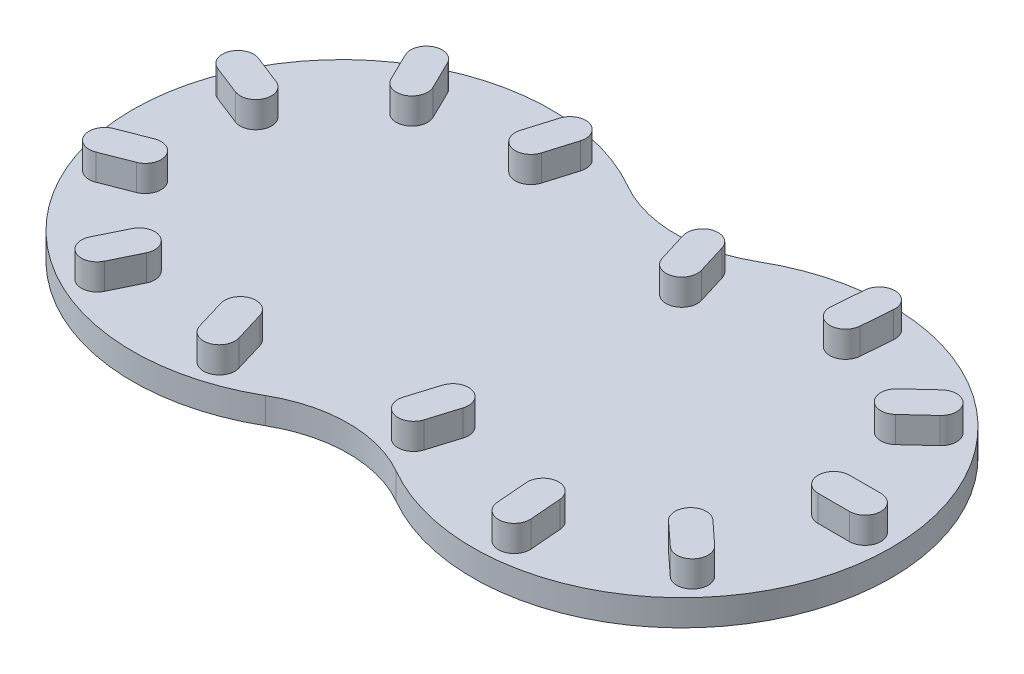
ISO-10303-21;
HEADER;
FILE_DESCRIPTION(('STEP AP214'),'2;1');
FILE_NAME('part.step','',(''),(''),'','','');
FILE_SCHEMA(('AUTOMOTIVE_DESIGN { 1 0 10303 214 1 1 1 1 }'));
ENDSEC;
DATA;
#1=APPLICATION_CONTEXT('core data for automotive mechanical design processes');
#2=APPLICATION_PROTOCOL_DEFINITION('international standard','automotive_design',2000,#1);
#3=PRODUCT_CONTEXT('',#1,'mechanical');
#4=PRODUCT('Part','Part','',(#3));
#5=PRODUCT_RELATED_PRODUCT_CATEGORY('part','',(#4));
#6=PRODUCT_DEFINITION_FORMATION('','',#4);
#7=PRODUCT_DEFINITION_CONTEXT('part definition',#1,'design');
#8=PRODUCT_DEFINITION('design','',#6,#7);
#9=PRODUCT_DEFINITION_SHAPE('','',#8);
#10=(LENGTH_UNIT() NAMED_UNIT(*) SI_UNIT(.MILLI.,.METRE.));
#11=(NAMED_UNIT(*) PLANE_ANGLE_UNIT() SI_UNIT($,.RADIAN.));
#12=(NAMED_UNIT(*) SI_UNIT($,.STERADIAN.) SOLID_ANGLE_UNIT());
#13=UNCERTAINTY_MEASURE_WITH_UNIT(LENGTH_MEASURE(1.E-05),#10,'distance_accuracy_value','');
#14=(GEOMETRIC_REPRESENTATION_CONTEXT(3) GLOBAL_UNCERTAINTY_ASSIGNED_CONTEXT((#13)) GLOBAL_UNIT_ASSIGNED_CONTEXT((#10,
#11,#12)) REPRESENTATION_CONTEXT('',''));
#15=CARTESIAN_POINT('',(0.,0.,0.));
#16=DIRECTION('',(0.,0.,1.));
#17=DIRECTION('',(1.,0.,0.));
#18=AXIS2_PLACEMENT_3D('',#15,#16,#17);
#19=CARTESIAN_POINT('',(48.75,5.,-28.1458256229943));
#20=DIRECTION('',(0.,1.,0.));
#21=DIRECTION('',(0.,0.,1.));
#22=AXIS2_PLACEMENT_3D('',#19,#20,#21);
#23=PLANE('',#22);
#24=DIRECTION('',(0.0804665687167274,0.,0.99675730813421));
#25=VECTOR('',#24,1.);
#26=CARTESIAN_POINT('',(64.3432585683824,5.00000000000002,29.1473616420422));
#27=LINE('',#26,#25);
#28=CARTESIAN_POINT('',(64.3432585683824,5.00000000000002,29.1473616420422));
#29=VERTEX_POINT('',#28);
#30=CARTESIAN_POINT('',(64.8260579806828,4.99999999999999,35.1279054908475));
#31=VERTEX_POINT('',#30);
#32=EDGE_CURVE('E462',#29,#31,#27,.T.);
#33=ORIENTED_EDGE('',*,*,#32,.F.);
#34=CARTESIAN_POINT('',(67.333530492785,5.00000000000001,28.9059619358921));
#35=DIRECTION('',(0.,1.,0.));
#36=DIRECTION('',(-0.99675730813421,0.,0.0804665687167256));
#37=AXIS2_PLACEMENT_3D('',#34,#35,#36);
#38=CIRCLE('',#37,3.);
#39=CARTESIAN_POINT('',(70.3238024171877,5.00000000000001,28.6645622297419));
#40=VERTEX_POINT('',#39);
#41=EDGE_CURVE('E431',#40,#29,#38,.T.);
#42=ORIENTED_EDGE('',*,*,#41,.F.);
#43=DIRECTION('',(-0.0804665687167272,0.,-0.99675730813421));
#44=VECTOR('',#43,1.);
#45=CARTESIAN_POINT('',(70.806601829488,4.99999999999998,34.6451060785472));
#46=LINE('',#45,#44);
#47=CARTESIAN_POINT('',(70.806601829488,5.,34.6451060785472));
#48=VERTEX_POINT('',#47);
#49=EDGE_CURVE('E466',#48,#40,#46,.T.);
#50=ORIENTED_EDGE('',*,*,#49,.F.);
#51=CARTESIAN_POINT('',(67.8163299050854,4.99999999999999,34.8865057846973));
#52=DIRECTION('',(0.,1.,0.));
#53=DIRECTION('',(-0.99675730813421,0.,0.0804665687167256));
#54=AXIS2_PLACEMENT_3D('',#51,#52,#53);
#55=CIRCLE('',#54,3.);
#56=EDGE_CURVE('E464',#31,#48,#55,.T.);
#57=ORIENTED_EDGE('',*,*,#56,.F.);
#58=EDGE_LOOP('',(#33,#42,#50,#57));
#59=FACE_BOUND('',#58,.T.);
#60=DIRECTION('',(0.287874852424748,0.,0.957668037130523));
#61=VECTOR('',#60,1.);
#62=CARTESIAN_POINT('',(5.47536660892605,5.00000000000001,28.6359976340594));
#63=LINE('',#62,#61);
#64=CARTESIAN_POINT('',(5.47536660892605,5.00000000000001,28.6359976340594));
#65=VERTEX_POINT('',#64);
#66=CARTESIAN_POINT('',(7.20261572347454,4.99999999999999,34.3820058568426));
#67=VERTEX_POINT('',#66);
#68=EDGE_CURVE('E518',#65,#67,#63,.T.);
#69=ORIENTED_EDGE('',*,*,#68,.F.);
#70=CARTESIAN_POINT('',(8.34837072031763,5.00000000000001,27.7723730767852));
#71=DIRECTION('',(0.,1.,0.));
#72=DIRECTION('',(-0.957668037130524,0.,0.287874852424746));
#73=AXIS2_PLACEMENT_3D('',#70,#71,#72);
#74=CIRCLE('',#73,3.);
#75=CARTESIAN_POINT('',(11.2213748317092,5.00000000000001,26.908748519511));
#76=VERTEX_POINT('',#75);
#77=EDGE_CURVE('E515',#76,#65,#74,.T.);
#78=ORIENTED_EDGE('',*,*,#77,.F.);
#79=DIRECTION('',(-0.287874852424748,0.,-0.957668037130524));
#80=VECTOR('',#79,1.);
#81=CARTESIAN_POINT('',(12.9486239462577,4.99999999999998,32.6547567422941));
#82=LINE('',#81,#80);
#83=CARTESIAN_POINT('',(12.9486239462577,5.,32.6547567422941));
#84=VERTEX_POINT('',#83);
#85=EDGE_CURVE('E523',#84,#76,#82,.T.);
#86=ORIENTED_EDGE('',*,*,#85,.F.);
#87=CARTESIAN_POINT('',(10.0756198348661,4.99999999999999,33.5183812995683));
#88=DIRECTION('',(0.,1.,0.));
#89=DIRECTION('',(-0.957668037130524,0.,0.287874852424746));
#90=AXIS2_PLACEMENT_3D('',#87,#88,#89);
#91=CIRCLE('',#90,3.);
#92=EDGE_CURVE('E520',#67,#84,#91,.T.);
#93=ORIENTED_EDGE('',*,*,#92,.F.);
#94=EDGE_LOOP('',(#69,#78,#86,#93));
#95=FACE_BOUND('',#94,.T.);
#96=DIRECTION('',(-0.93139831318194,0.,0.3640016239));
#97=VECTOR('',#96,1.);
#98=CARTESIAN_POINT('',(-28.1025559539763,5.00000000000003,7.7618521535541));
#99=LINE('',#98,#97);
#100=CARTESIAN_POINT('',(-28.1025559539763,5.00000000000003,7.7618521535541));
#101=VERTEX_POINT('',#100);
#102=CARTESIAN_POINT('',(-33.6909458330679,5.,9.9458618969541));
#103=VERTEX_POINT('',#102);
#104=EDGE_CURVE('E576',#101,#103,#99,.T.);
#105=ORIENTED_EDGE('',*,*,#104,.F.);
#106=CARTESIAN_POINT('',(-27.0105510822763,5.00000000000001,10.5560470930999));
#107=DIRECTION('',(0.,1.,0.));
#108=DIRECTION('',(-0.364001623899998,0.,-0.931398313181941));
#109=AXIS2_PLACEMENT_3D('',#106,#107,#108);
#110=CIRCLE('',#109,3.);
#111=CARTESIAN_POINT('',(-25.9185462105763,5.,13.3502420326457));
#112=VERTEX_POINT('',#111);
#113=EDGE_CURVE('E573',#112,#101,#110,.T.);
#114=ORIENTED_EDGE('',*,*,#113,.F.);
#115=DIRECTION('',(0.93139831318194,0.,-0.364001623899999));
#116=VECTOR('',#115,1.);
#117=CARTESIAN_POINT('',(-31.5069360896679,4.99999999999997,15.5342517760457));
#118=LINE('',#117,#116);
#119=CARTESIAN_POINT('',(-31.5069360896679,5.,15.5342517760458));
#120=VERTEX_POINT('',#119);
#121=EDGE_CURVE('E581',#120,#112,#118,.T.);
#122=ORIENTED_EDGE('',*,*,#121,.F.);
#123=CARTESIAN_POINT('',(-32.5989409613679,4.99999999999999,12.7400568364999));
#124=DIRECTION('',(0.,1.,0.));
#125=DIRECTION('',(-0.364001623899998,0.,-0.931398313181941));
#126=AXIS2_PLACEMENT_3D('',#123,#124,#125);
#127=CIRCLE('',#126,3.);
#128=EDGE_CURVE('E578',#103,#120,#127,.T.);
#129=ORIENTED_EDGE('',*,*,#128,.F.);
#130=EDGE_LOOP('',(#105,#114,#122,#129));
#131=FACE_BOUND('',#130,.T.);
#132=DIRECTION('',(-0.437767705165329,0.,-0.899088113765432));
#133=VECTOR('',#132,1.);
#134=CARTESIAN_POINT('',(-9.9979991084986,4.99999999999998,-27.3868584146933));
#135=LINE('',#134,#133);
#136=CARTESIAN_POINT('',(-9.9979991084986,4.99999999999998,-27.3868584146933));
#137=VERTEX_POINT('',#136);
#138=CARTESIAN_POINT('',(-12.6246053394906,4.99999999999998,-32.7813870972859));
#139=VERTEX_POINT('',#138);
#140=EDGE_CURVE('E634',#137,#139,#135,.T.);
#141=ORIENTED_EDGE('',*,*,#140,.F.);
#142=CARTESIAN_POINT('',(-12.6952634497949,4.99999999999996,-26.0735552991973));
#143=DIRECTION('',(0.,1.,0.));
#144=DIRECTION('',(0.899088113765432,0.,-0.437767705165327));
#145=AXIS2_PLACEMENT_3D('',#142,#143,#144);
#146=CIRCLE('',#145,3.);
#147=CARTESIAN_POINT('',(-15.3925277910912,4.99999999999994,-24.7602521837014));
#148=VERTEX_POINT('',#147);
#149=EDGE_CURVE('E631',#148,#137,#146,.T.);
#150=ORIENTED_EDGE('',*,*,#149,.F.);
#151=DIRECTION('',(0.437767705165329,0.,0.899088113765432));
#152=VECTOR('',#151,1.);
#153=CARTESIAN_POINT('',(-18.0191340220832,4.99999999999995,-30.154780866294));
#154=LINE('',#153,#152);
#155=CARTESIAN_POINT('',(-18.0191340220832,5.,-30.154780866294));
#156=VERTEX_POINT('',#155);
#157=EDGE_CURVE('E639',#156,#148,#154,.T.);
#158=ORIENTED_EDGE('',*,*,#157,.F.);
#159=CARTESIAN_POINT('',(-15.3218696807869,4.99999999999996,-31.4680839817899));
#160=DIRECTION('',(0.,1.,0.));
#161=DIRECTION('',(0.899088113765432,0.,-0.437767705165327));
#162=AXIS2_PLACEMENT_3D('',#159,#160,#161);
#163=CIRCLE('',#162,3.);
#164=EDGE_CURVE('E636',#139,#156,#163,.T.);
#165=ORIENTED_EDGE('',*,*,#164,.F.);
#166=EDGE_LOOP('',(#141,#150,#158,#165));
#167=FACE_BOUND('',#166,.T.);
#168=DIRECTION('',(-0.29365533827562,0.,-0.955911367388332));
#169=VECTOR('',#168,1.);
#170=CARTESIAN_POINT('',(45.9393262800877,4.99999999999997,-22.7598080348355));
#171=LINE('',#170,#169);
#172=CARTESIAN_POINT('',(45.9393262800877,4.99999999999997,-22.7598080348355));
#173=VERTEX_POINT('',#172);
#174=CARTESIAN_POINT('',(44.177394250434,4.99999999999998,-28.4952762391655));
#175=VERTEX_POINT('',#174);
#176=EDGE_CURVE('E692',#173,#175,#171,.T.);
#177=ORIENTED_EDGE('',*,*,#176,.F.);
#178=CARTESIAN_POINT('',(43.0715921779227,4.99999999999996,-21.8788420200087));
#179=DIRECTION('',(0.,1.,0.));
#180=DIRECTION('',(0.955911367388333,0.,-0.293655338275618));
#181=AXIS2_PLACEMENT_3D('',#178,#179,#180);
#182=CIRCLE('',#181,3.);
#183=CARTESIAN_POINT('',(40.2038580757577,4.99999999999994,-20.9978760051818));
#184=VERTEX_POINT('',#183);
#185=EDGE_CURVE('E689',#184,#173,#182,.T.);
#186=ORIENTED_EDGE('',*,*,#185,.F.);
#187=DIRECTION('',(0.29365533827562,0.,0.955911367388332));
#188=VECTOR('',#187,1.);
#189=CARTESIAN_POINT('',(38.441926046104,4.99999999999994,-26.7333442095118));
#190=LINE('',#189,#188);
#191=CARTESIAN_POINT('',(38.441926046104,5.,-26.7333442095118));
#192=VERTEX_POINT('',#191);
#193=EDGE_CURVE('E697',#192,#184,#190,.T.);
#194=ORIENTED_EDGE('',*,*,#193,.F.);
#195=CARTESIAN_POINT('',(41.309660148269,4.99999999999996,-27.6143102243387));
#196=DIRECTION('',(0.,1.,0.));
#197=DIRECTION('',(0.955911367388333,0.,-0.293655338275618));
#198=AXIS2_PLACEMENT_3D('',#195,#196,#197);
#199=CIRCLE('',#198,3.);
#200=EDGE_CURVE('E694',#175,#192,#199,.T.);
#201=ORIENTED_EDGE('',*,*,#200,.F.);
#202=EDGE_LOOP('',(#177,#186,#194,#201));
#203=FACE_BOUND('',#202,.T.);
#204=DIRECTION('',(0.735005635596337,0.,-0.678060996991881));
#205=VECTOR('',#204,1.);
#206=CARTESIAN_POINT('',(88.3493464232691,4.99999999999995,-17.4587520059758));
#207=LINE('',#206,#205);
#208=CARTESIAN_POINT('',(88.3493464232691,4.99999999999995,-17.4587520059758));
#209=VERTEX_POINT('',#208);
#210=CARTESIAN_POINT('',(92.7593802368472,4.99999999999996,-21.5271179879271));
#211=VERTEX_POINT('',#210);
#212=EDGE_CURVE('E750',#209,#211,#207,.T.);
#213=ORIENTED_EDGE('',*,*,#212,.F.);
#214=CARTESIAN_POINT('',(86.3151634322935,4.99999999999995,-19.6637689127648));
#215=DIRECTION('',(0.,1.,0.));
#216=DIRECTION('',(0.67806099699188,0.,0.735005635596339));
#217=AXIS2_PLACEMENT_3D('',#214,#215,#216);
#218=CIRCLE('',#217,3.);
#219=CARTESIAN_POINT('',(84.2809804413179,4.99999999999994,-21.8687858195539));
#220=VERTEX_POINT('',#219);
#221=EDGE_CURVE('E747',#220,#209,#218,.T.);
#222=ORIENTED_EDGE('',*,*,#221,.F.);
#223=DIRECTION('',(-0.735005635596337,0.,0.678060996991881));
#224=VECTOR('',#223,1.);
#225=CARTESIAN_POINT('',(88.6910142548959,4.99999999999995,-25.9371518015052));
#226=LINE('',#225,#224);
#227=CARTESIAN_POINT('',(88.6910142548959,5.,-25.9371518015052));
#228=VERTEX_POINT('',#227);
#229=EDGE_CURVE('E755',#228,#220,#226,.T.);
#230=ORIENTED_EDGE('',*,*,#229,.F.);
#231=CARTESIAN_POINT('',(90.7251972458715,4.99999999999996,-23.7321348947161));
#232=DIRECTION('',(0.,1.,0.));
#233=DIRECTION('',(0.67806099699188,0.,0.735005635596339));
#234=AXIS2_PLACEMENT_3D('',#231,#232,#233);
#235=CIRCLE('',#234,3.);
#236=EDGE_CURVE('E752',#211,#228,#235,.T.);
#237=ORIENTED_EDGE('',*,*,#236,.F.);
#238=EDGE_LOOP('',(#213,#222,#230,#237));
#239=FACE_BOUND('',#238,.T.);
#240=CARTESIAN_POINT('',(32.5,5.,-56.2916512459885));
#241=DIRECTION('',(0.,-1.,0.));
#242=DIRECTION('',(0.,0.,1.));
#243=AXIS2_PLACEMENT_3D('',#240,#241,#242);
#244=CIRCLE('',#243,25.);
#245=CARTESIAN_POINT('',(45.,5.,-34.6410161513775));
#246=VERTEX_POINT('',#245);
#247=CARTESIAN_POINT('',(20.,5.,-34.6410161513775));
#248=VERTEX_POINT('',#247);
#249=EDGE_CURVE('E814',#246,#248,#244,.T.);
#250=ORIENTED_EDGE('',*,*,#249,.T.);
#251=CARTESIAN_POINT('',(0.,5.,0.));
#252=DIRECTION('',(0.,1.,0.));
#253=DIRECTION('',(0.,0.,1.));
#254=AXIS2_PLACEMENT_3D('',#251,#252,#253);
#255=CIRCLE('',#254,40.);
#256=CARTESIAN_POINT('',(20.,5.,34.6410161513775));
#257=VERTEX_POINT('',#256);
#258=EDGE_CURVE('E817',#248,#257,#255,.T.);
#259=ORIENTED_EDGE('',*,*,#258,.T.);
#260=CARTESIAN_POINT('',(32.5,5.,56.2916512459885));
#261=DIRECTION('',(0.,-1.,0.));
#262=DIRECTION('',(0.,0.,1.));
#263=AXIS2_PLACEMENT_3D('',#260,#261,#262);
#264=CIRCLE('',#263,25.);
#265=CARTESIAN_POINT('',(45.,5.,34.6410161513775));
#266=VERTEX_POINT('',#265);
#267=EDGE_CURVE('E819',#257,#266,#264,.T.);
#268=ORIENTED_EDGE('',*,*,#267,.T.);
#269=CARTESIAN_POINT('',(65.,5.,0.));
#270=DIRECTION('',(0.,1.,0.));
#271=DIRECTION('',(0.,0.,-1.));
#272=AXIS2_PLACEMENT_3D('',#269,#270,#271);
#273=CIRCLE('',#272,40.);
#274=EDGE_CURVE('E821',#266,#246,#273,.T.);
#275=ORIENTED_EDGE('',*,*,#274,.T.);
#276=EDGE_LOOP('',(#250,#259,#268,#275));
#277=FACE_BOUND('',#276,.T.);
#278=DIRECTION('',(1.,0.,0.));
#279=VECTOR('',#278,1.);
#280=CARTESIAN_POINT('',(94.,5.,3.00000000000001));
#281=LINE('',#280,#279);
#282=CARTESIAN_POINT('',(94.,5.,3.00000000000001));
#283=VERTEX_POINT('',#282);
#284=CARTESIAN_POINT('',(100.,5.,3.));
#285=VERTEX_POINT('',#284);
#286=EDGE_CURVE('E779',#283,#285,#281,.T.);
#287=ORIENTED_EDGE('',*,*,#286,.F.);
#288=CARTESIAN_POINT('',(94.,5.,0.));
#289=DIRECTION('',(0.,1.,0.));
#290=DIRECTION('',(0.,0.,1.));
#291=AXIS2_PLACEMENT_3D('',#288,#289,#290);
#292=CIRCLE('',#291,3.);
#293=CARTESIAN_POINT('',(94.,5.,-2.99999999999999));
#294=VERTEX_POINT('',#293);
#295=EDGE_CURVE('E776',#294,#283,#292,.T.);
#296=ORIENTED_EDGE('',*,*,#295,.F.);
#297=DIRECTION('',(-1.,0.,0.));
#298=VECTOR('',#297,1.);
#299=CARTESIAN_POINT('',(100.,5.,-3.));
#300=LINE('',#299,#298);
#301=CARTESIAN_POINT('',(100.,5.,-3.));
#302=VERTEX_POINT('',#301);
#303=EDGE_CURVE('E784',#302,#294,#300,.T.);
#304=ORIENTED_EDGE('',*,*,#303,.F.);
#305=CARTESIAN_POINT('',(100.,5.,0.));
#306=DIRECTION('',(0.,1.,0.));
#307=DIRECTION('',(0.,0.,1.));
#308=AXIS2_PLACEMENT_3D('',#305,#306,#307);
#309=CIRCLE('',#308,3.);
#310=EDGE_CURVE('E781',#285,#302,#309,.T.);
#311=ORIENTED_EDGE('',*,*,#310,.F.);
#312=EDGE_LOOP('',(#287,#296,#304,#311));
#313=FACE_BOUND('',#312,.T.);
#314=DIRECTION('',(0.0804665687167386,0.,-0.996757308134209));
#315=VECTOR('',#314,1.);
#316=CARTESIAN_POINT('',(70.3238024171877,4.99999999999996,-28.6645622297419));
#317=LINE('',#316,#315);
#318=CARTESIAN_POINT('',(70.3238024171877,4.99999999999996,-28.6645622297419));
#319=VERTEX_POINT('',#318);
#320=CARTESIAN_POINT('',(70.8066018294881,4.99999999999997,-34.6451060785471));
#321=VERTEX_POINT('',#320);
#322=EDGE_CURVE('E721',#319,#321,#317,.T.);
#323=ORIENTED_EDGE('',*,*,#322,.F.);
#324=CARTESIAN_POINT('',(67.333530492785,4.99999999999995,-28.9059619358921));
#325=DIRECTION('',(0.,1.,0.));
#326=DIRECTION('',(0.996757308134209,0.,0.0804665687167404));
#327=AXIS2_PLACEMENT_3D('',#324,#325,#326);
#328=CIRCLE('',#327,3.);
#329=CARTESIAN_POINT('',(64.3432585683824,4.99999999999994,-29.1473616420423));
#330=VERTEX_POINT('',#329);
#331=EDGE_CURVE('E718',#330,#319,#328,.T.);
#332=ORIENTED_EDGE('',*,*,#331,.F.);
#333=DIRECTION('',(-0.0804665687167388,0.,0.996757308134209));
#334=VECTOR('',#333,1.);
#335=CARTESIAN_POINT('',(64.8260579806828,4.99999999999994,-35.1279054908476));
#336=LINE('',#335,#334);
#337=CARTESIAN_POINT('',(64.8260579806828,5.,-35.1279054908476));
#338=VERTEX_POINT('',#337);
#339=EDGE_CURVE('E726',#338,#330,#336,.T.);
#340=ORIENTED_EDGE('',*,*,#339,.F.);
#341=CARTESIAN_POINT('',(67.8163299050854,4.99999999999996,-34.8865057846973));
#342=DIRECTION('',(0.,1.,0.));
#343=DIRECTION('',(0.996757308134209,0.,0.0804665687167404));
#344=AXIS2_PLACEMENT_3D('',#341,#342,#343);
#345=CIRCLE('',#344,3.);
#346=EDGE_CURVE('E723',#321,#338,#345,.T.);
#347=ORIENTED_EDGE('',*,*,#346,.F.);
#348=EDGE_LOOP('',(#323,#332,#340,#347));
#349=FACE_BOUND('',#348,.T.);
#350=DIRECTION('',(0.287874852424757,0.,-0.957668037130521));
#351=VECTOR('',#350,1.);
#352=CARTESIAN_POINT('',(11.2213748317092,4.99999999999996,-26.9087485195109));
#353=LINE('',#352,#351);
#354=CARTESIAN_POINT('',(11.2213748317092,4.99999999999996,-26.9087485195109));
#355=VERTEX_POINT('',#354);
#356=CARTESIAN_POINT('',(12.9486239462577,4.99999999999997,-32.6547567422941));
#357=VERTEX_POINT('',#356);
#358=EDGE_CURVE('E663',#355,#357,#353,.T.);
#359=ORIENTED_EDGE('',*,*,#358,.F.);
#360=CARTESIAN_POINT('',(8.34837072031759,4.99999999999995,-27.7723730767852));
#361=DIRECTION('',(0.,1.,0.));
#362=DIRECTION('',(0.95766803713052,0.,0.287874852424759));
#363=AXIS2_PLACEMENT_3D('',#360,#361,#362);
#364=CIRCLE('',#363,3.);
#365=CARTESIAN_POINT('',(5.47536660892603,4.99999999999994,-28.6359976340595));
#366=VERTEX_POINT('',#365);
#367=EDGE_CURVE('E660',#366,#355,#364,.T.);
#368=ORIENTED_EDGE('',*,*,#367,.F.);
#369=DIRECTION('',(-0.287874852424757,0.,0.957668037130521));
#370=VECTOR('',#369,1.);
#371=CARTESIAN_POINT('',(7.20261572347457,4.99999999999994,-34.3820058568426));
#372=LINE('',#371,#370);
#373=CARTESIAN_POINT('',(7.20261572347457,5.,-34.3820058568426));
#374=VERTEX_POINT('',#373);
#375=EDGE_CURVE('E668',#374,#366,#372,.T.);
#376=ORIENTED_EDGE('',*,*,#375,.F.);
#377=CARTESIAN_POINT('',(10.0756198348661,4.99999999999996,-33.5183812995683));
#378=DIRECTION('',(0.,1.,0.));
#379=DIRECTION('',(0.95766803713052,0.,0.287874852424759));
#380=AXIS2_PLACEMENT_3D('',#377,#378,#379);
#381=CIRCLE('',#380,3.);
#382=EDGE_CURVE('E665',#357,#374,#381,.T.);
#383=ORIENTED_EDGE('',*,*,#382,.F.);
#384=EDGE_LOOP('',(#359,#368,#376,#383));
#385=FACE_BOUND('',#384,.T.);
#386=DIRECTION('',(-0.931398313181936,0.,-0.364001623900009));
#387=VECTOR('',#386,1.);
#388=CARTESIAN_POINT('',(-25.9185462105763,5.00000000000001,-13.3502420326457));
#389=LINE('',#388,#387);
#390=CARTESIAN_POINT('',(-25.9185462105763,5.00000000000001,-13.3502420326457));
#391=VERTEX_POINT('',#390);
#392=CARTESIAN_POINT('',(-31.5069360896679,4.99999999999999,-15.5342517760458));
#393=VERTEX_POINT('',#392);
#394=EDGE_CURVE('E605',#391,#393,#389,.T.);
#395=ORIENTED_EDGE('',*,*,#394,.F.);
#396=CARTESIAN_POINT('',(-27.0105510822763,4.99999999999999,-10.5560470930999));
#397=DIRECTION('',(0.,1.,0.));
#398=DIRECTION('',(0.364001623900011,0.,-0.931398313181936));
#399=AXIS2_PLACEMENT_3D('',#396,#397,#398);
#400=CIRCLE('',#399,3.);
#401=CARTESIAN_POINT('',(-28.1025559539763,4.99999999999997,-7.7618521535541));
#402=VERTEX_POINT('',#401);
#403=EDGE_CURVE('E602',#402,#391,#400,.T.);
#404=ORIENTED_EDGE('',*,*,#403,.F.);
#405=DIRECTION('',(0.931398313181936,0.,0.36400162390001));
#406=VECTOR('',#405,1.);
#407=CARTESIAN_POINT('',(-33.6909458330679,4.99999999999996,-9.94586189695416));
#408=LINE('',#407,#406);
#409=CARTESIAN_POINT('',(-33.690945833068,5.,-9.94586189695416));
#410=VERTEX_POINT('',#409);
#411=EDGE_CURVE('E610',#410,#402,#408,.T.);
#412=ORIENTED_EDGE('',*,*,#411,.F.);
#413=CARTESIAN_POINT('',(-32.5989409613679,4.99999999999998,-12.7400568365));
#414=DIRECTION('',(0.,1.,0.));
#415=DIRECTION('',(0.364001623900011,0.,-0.931398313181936));
#416=AXIS2_PLACEMENT_3D('',#413,#414,#415);
#417=CIRCLE('',#416,3.);
#418=EDGE_CURVE('E607',#393,#410,#417,.T.);
#419=ORIENTED_EDGE('',*,*,#418,.F.);
#420=EDGE_LOOP('',(#395,#404,#412,#419));
#421=FACE_BOUND('',#420,.T.);
#422=DIRECTION('',(-0.437767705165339,0.,0.899088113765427));
#423=VECTOR('',#422,1.);
#424=CARTESIAN_POINT('',(-15.3925277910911,5.00000000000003,24.7602521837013));
#425=LINE('',#424,#423);
#426=CARTESIAN_POINT('',(-15.3925277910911,5.00000000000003,24.7602521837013));
#427=VERTEX_POINT('',#426);
#428=CARTESIAN_POINT('',(-18.0191340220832,5.,30.1547808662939));
#429=VERTEX_POINT('',#428);
#430=EDGE_CURVE('E547',#427,#429,#425,.T.);
#431=ORIENTED_EDGE('',*,*,#430,.F.);
#432=CARTESIAN_POINT('',(-12.6952634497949,5.00000000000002,26.0735552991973));
#433=DIRECTION('',(0.,1.,0.));
#434=DIRECTION('',(-0.899088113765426,0.,-0.437767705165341));
#435=AXIS2_PLACEMENT_3D('',#432,#433,#434);
#436=CIRCLE('',#435,3.);
#437=CARTESIAN_POINT('',(-9.99799910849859,5.00000000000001,27.3868584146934));
#438=VERTEX_POINT('',#437);
#439=EDGE_CURVE('E544',#438,#427,#436,.T.);
#440=ORIENTED_EDGE('',*,*,#439,.F.);
#441=DIRECTION('',(0.437767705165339,0.,-0.899088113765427));
#442=VECTOR('',#441,1.);
#443=CARTESIAN_POINT('',(-12.6246053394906,4.99999999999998,32.7813870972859));
#444=LINE('',#443,#442);
#445=CARTESIAN_POINT('',(-12.6246053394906,5.,32.781387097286));
#446=VERTEX_POINT('',#445);
#447=EDGE_CURVE('E552',#446,#438,#444,.T.);
#448=ORIENTED_EDGE('',*,*,#447,.F.);
#449=CARTESIAN_POINT('',(-15.3218696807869,4.99999999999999,31.4680839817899));
#450=DIRECTION('',(0.,1.,0.));
#451=DIRECTION('',(-0.899088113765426,0.,-0.437767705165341));
#452=AXIS2_PLACEMENT_3D('',#449,#450,#451);
#453=CIRCLE('',#452,3.);
#454=EDGE_CURVE('E549',#429,#446,#453,.T.);
#455=ORIENTED_EDGE('',*,*,#454,.F.);
#456=EDGE_LOOP('',(#431,#440,#448,#455));
#457=FACE_BOUND('',#456,.T.);
#458=DIRECTION('',(-0.293655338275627,0.,0.95591136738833));
#459=VECTOR('',#458,1.);
#460=CARTESIAN_POINT('',(40.2038580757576,5.00000000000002,20.9978760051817));
#461=LINE('',#460,#459);
#462=CARTESIAN_POINT('',(40.2038580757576,5.00000000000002,20.9978760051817));
#463=VERTEX_POINT('',#462);
#464=CARTESIAN_POINT('',(38.4419260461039,5.,26.7333442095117));
#465=VERTEX_POINT('',#464);
#466=EDGE_CURVE('E489',#463,#465,#461,.T.);
#467=ORIENTED_EDGE('',*,*,#466,.F.);
#468=CARTESIAN_POINT('',(43.0715921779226,5.00000000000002,21.8788420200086));
#469=DIRECTION('',(0.,1.,0.));
#470=DIRECTION('',(-0.95591136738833,0.,-0.293655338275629));
#471=AXIS2_PLACEMENT_3D('',#468,#469,#470);
#472=CIRCLE('',#471,3.);
#473=CARTESIAN_POINT('',(45.9393262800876,5.00000000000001,22.7598080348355));
#474=VERTEX_POINT('',#473);
#475=EDGE_CURVE('E486',#474,#463,#472,.T.);
#476=ORIENTED_EDGE('',*,*,#475,.F.);
#477=DIRECTION('',(0.293655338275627,0.,-0.95591136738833));
#478=VECTOR('',#477,1.);
#479=CARTESIAN_POINT('',(44.1773942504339,4.99999999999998,28.4952762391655));
#480=LINE('',#479,#478);
#481=CARTESIAN_POINT('',(44.1773942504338,5.,28.4952762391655));
#482=VERTEX_POINT('',#481);
#483=EDGE_CURVE('E494',#482,#474,#480,.T.);
#484=ORIENTED_EDGE('',*,*,#483,.F.);
#485=CARTESIAN_POINT('',(41.3096601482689,4.99999999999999,27.6143102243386));
#486=DIRECTION('',(0.,1.,0.));
#487=DIRECTION('',(-0.95591136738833,0.,-0.293655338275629));
#488=AXIS2_PLACEMENT_3D('',#485,#486,#487);
#489=CIRCLE('',#488,3.);
#490=EDGE_CURVE('E491',#465,#482,#489,.T.);
#491=ORIENTED_EDGE('',*,*,#490,.F.);
#492=EDGE_LOOP('',(#467,#476,#484,#491));
#493=FACE_BOUND('',#492,.T.);
#494=DIRECTION('',(0.735005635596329,0.,0.67806099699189));
#495=VECTOR('',#494,1.);
#496=CARTESIAN_POINT('',(84.2809804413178,4.99999999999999,21.8687858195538));
#497=LINE('',#496,#495);
#498=CARTESIAN_POINT('',(84.2809804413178,4.99999999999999,21.8687858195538));
#499=VERTEX_POINT('',#498);
#500=CARTESIAN_POINT('',(88.6910142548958,4.99999999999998,25.9371518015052));
#501=VERTEX_POINT('',#500);
#502=EDGE_CURVE('E425',#499,#501,#497,.T.);
#503=ORIENTED_EDGE('',*,*,#502,.F.);
#504=CARTESIAN_POINT('',(86.3151634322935,4.99999999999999,19.6637689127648));
#505=DIRECTION('',(0.,1.,0.));
#506=DIRECTION('',(-0.678060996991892,0.,0.735005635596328));
#507=AXIS2_PLACEMENT_3D('',#504,#505,#506);
#508=CIRCLE('',#507,3.);
#509=CARTESIAN_POINT('',(88.3493464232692,4.99999999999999,17.4587520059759));
#510=VERTEX_POINT('',#509);
#511=EDGE_CURVE('E436',#510,#499,#508,.T.);
#512=ORIENTED_EDGE('',*,*,#511,.F.);
#513=DIRECTION('',(-0.735005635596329,0.,-0.67806099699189));
#514=VECTOR('',#513,1.);
#515=CARTESIAN_POINT('',(92.7593802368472,4.99999999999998,21.5271179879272));
#516=LINE('',#515,#514);
#517=CARTESIAN_POINT('',(92.7593802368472,5.,21.5271179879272));
#518=VERTEX_POINT('',#517);
#519=EDGE_CURVE('E446',#518,#510,#516,.T.);
#520=ORIENTED_EDGE('',*,*,#519,.F.);
#521=CARTESIAN_POINT('',(90.7251972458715,4.99999999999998,23.7321348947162));
#522=DIRECTION('',(0.,1.,0.));
#523=DIRECTION('',(-0.678060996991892,0.,0.735005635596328));
#524=AXIS2_PLACEMENT_3D('',#521,#522,#523);
#525=CIRCLE('',#524,3.);
#526=EDGE_CURVE('E444',#501,#518,#525,.T.);
#527=ORIENTED_EDGE('',*,*,#526,.F.);
#528=EDGE_LOOP('',(#503,#512,#520,#527));
#529=FACE_BOUND('',#528,.T.);
#530=ADVANCED_FACE('F66',(#59,#95,#131,#167,#203,#239,#277,#313,#349,#385,#421,#457,#493,#529),
#23,.T.);
#531=CARTESIAN_POINT('',(32.5,5.,-56.2916512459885));
#532=DIRECTION('',(0.,-1.,0.));
#533=DIRECTION('',(0.,0.,-1.));
#534=AXIS2_PLACEMENT_3D('',#531,#532,#533);
#535=CYLINDRICAL_SURFACE('',#534,25.);
#536=CARTESIAN_POINT('',(32.5,0.,-56.2916512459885));
#537=DIRECTION('',(0.,-1.,0.));
#538=DIRECTION('',(0.,0.,1.));
#539=AXIS2_PLACEMENT_3D('',#536,#537,#538);
#540=CIRCLE('',#539,25.);
#541=CARTESIAN_POINT('',(45.,0.,-34.6410161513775));
#542=VERTEX_POINT('',#541);
#543=CARTESIAN_POINT('',(20.,0.,-34.6410161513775));
#544=VERTEX_POINT('',#543);
#545=EDGE_CURVE('E805',#542,#544,#540,.T.);
#546=ORIENTED_EDGE('',*,*,#545,.T.);
#547=DIRECTION('',(0.,-1.,0.));
#548=VECTOR('',#547,1.);
#549=CARTESIAN_POINT('',(20.,5.,-34.6410161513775));
#550=LINE('',#549,#548);
#551=EDGE_CURVE('E13',#248,#544,#550,.T.);
#552=ORIENTED_EDGE('',*,*,#551,.F.);
#553=ORIENTED_EDGE('',*,*,#249,.F.);
#554=DIRECTION('',(0.,-1.,0.));
#555=VECTOR('',#554,1.);
#556=CARTESIAN_POINT('',(45.,5.,-34.6410161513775));
#557=LINE('',#556,#555);
#558=EDGE_CURVE('E823',#246,#542,#557,.T.);
#559=ORIENTED_EDGE('',*,*,#558,.T.);
#560=EDGE_LOOP('',(#546,#552,#553,#559));
#561=FACE_BOUND('',#560,.T.);
#562=ADVANCED_FACE('F68',(#561),#535,.F.);
#563=CARTESIAN_POINT('',(0.,5.,0.));
#564=DIRECTION('',(0.,-1.,0.));
#565=DIRECTION('',(0.,0.,-1.));
#566=AXIS2_PLACEMENT_3D('',#563,#564,#565);
#567=CYLINDRICAL_SURFACE('',#566,40.);
#568=CARTESIAN_POINT('',(0.,0.,0.));
#569=DIRECTION('',(0.,1.,0.));
#570=DIRECTION('',(0.,0.,1.));
#571=AXIS2_PLACEMENT_3D('',#568,#569,#570);
#572=CIRCLE('',#571,40.);
#573=CARTESIAN_POINT('',(20.,0.,34.6410161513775));
#574=VERTEX_POINT('',#573);
#575=EDGE_CURVE('E808',#544,#574,#572,.T.);
#576=ORIENTED_EDGE('',*,*,#575,.T.);
#577=DIRECTION('',(0.,-1.,0.));
#578=VECTOR('',#577,1.);
#579=CARTESIAN_POINT('',(20.,5.,34.6410161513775));
#580=LINE('',#579,#578);
#581=EDGE_CURVE('E74',#257,#574,#580,.T.);
#582=ORIENTED_EDGE('',*,*,#581,.F.);
#583=ORIENTED_EDGE('',*,*,#258,.F.);
#584=ORIENTED_EDGE('',*,*,#551,.T.);
#585=EDGE_LOOP('',(#576,#582,#583,#584));
#586=FACE_BOUND('',#585,.T.);
#587=ADVANCED_FACE('F849',(#586),#567,.T.);
#588=CARTESIAN_POINT('',(32.5,5.,56.2916512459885));
#589=DIRECTION('',(0.,-1.,0.));
#590=DIRECTION('',(0.,0.,-1.));
#591=AXIS2_PLACEMENT_3D('',#588,#589,#590);
#592=CYLINDRICAL_SURFACE('',#591,25.);
#593=CARTESIAN_POINT('',(32.5,0.,56.2916512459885));
#594=DIRECTION('',(0.,-1.,0.));
#595=DIRECTION('',(0.,0.,1.));
#596=AXIS2_PLACEMENT_3D('',#593,#594,#595);
#597=CIRCLE('',#596,25.);
#598=CARTESIAN_POINT('',(45.,0.,34.6410161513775));
#599=VERTEX_POINT('',#598);
#600=EDGE_CURVE('E810',#574,#599,#597,.T.);
#601=ORIENTED_EDGE('',*,*,#600,.T.);
#602=DIRECTION('',(0.,-1.,0.));
#603=VECTOR('',#602,1.);
#604=CARTESIAN_POINT('',(45.,5.,34.6410161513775));
#605=LINE('',#604,#603);
#606=EDGE_CURVE('E826',#266,#599,#605,.T.);
#607=ORIENTED_EDGE('',*,*,#606,.F.);
#608=ORIENTED_EDGE('',*,*,#267,.F.);
#609=ORIENTED_EDGE('',*,*,#581,.T.);
#610=EDGE_LOOP('',(#601,#607,#608,#609));
#611=FACE_BOUND('',#610,.T.);
#612=ADVANCED_FACE('F833',(#611),#592,.F.);
#613=CARTESIAN_POINT('',(65.,5.,0.));
#614=DIRECTION('',(0.,-1.,0.));
#615=DIRECTION('',(0.,0.,-1.));
#616=AXIS2_PLACEMENT_3D('',#613,#614,#615);
#617=CYLINDRICAL_SURFACE('',#616,40.);
#618=CARTESIAN_POINT('',(65.,0.,0.));
#619=DIRECTION('',(0.,1.,0.));
#620=DIRECTION('',(0.,0.,-1.));
#621=AXIS2_PLACEMENT_3D('',#618,#619,#620);
#622=CIRCLE('',#621,40.);
#623=EDGE_CURVE('E812',#599,#542,#622,.T.);
#624=ORIENTED_EDGE('',*,*,#623,.T.);
#625=ORIENTED_EDGE('',*,*,#558,.F.);
#626=ORIENTED_EDGE('',*,*,#274,.F.);
#627=ORIENTED_EDGE('',*,*,#606,.T.);
#628=EDGE_LOOP('',(#624,#625,#626,#627));
#629=FACE_BOUND('',#628,.T.);
#630=ADVANCED_FACE('F842',(#629),#617,.T.);
#631=CARTESIAN_POINT('',(48.75,0.,-28.1458256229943));
#632=DIRECTION('',(0.,1.,0.));
#633=DIRECTION('',(0.,0.,1.));
#634=AXIS2_PLACEMENT_3D('',#631,#632,#633);
#635=PLANE('',#634);
#636=ORIENTED_EDGE('',*,*,#545,.F.);
#637=ORIENTED_EDGE('',*,*,#623,.F.);
#638=ORIENTED_EDGE('',*,*,#600,.F.);
#639=ORIENTED_EDGE('',*,*,#575,.F.);
#640=EDGE_LOOP('',(#636,#637,#638,#639));
#641=FACE_BOUND('',#640,.T.);
#642=ADVANCED_FACE('F839',(#641),#635,.F.);
#643=CARTESIAN_POINT('',(94.,10.,0.));
#644=DIRECTION('',(0.,-1.,0.));
#645=DIRECTION('',(0.,0.,-1.));
#646=AXIS2_PLACEMENT_3D('',#643,#644,#645);
#647=CYLINDRICAL_SURFACE('',#646,3.);
#648=ORIENTED_EDGE('',*,*,#295,.T.);
#649=DIRECTION('',(0.,-1.,0.));
#650=VECTOR('',#649,1.);
#651=CARTESIAN_POINT('',(94.,10.,3.00000000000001));
#652=LINE('',#651,#650);
#653=CARTESIAN_POINT('',(94.,10.,3.00000000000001));
#654=VERTEX_POINT('',#653);
#655=EDGE_CURVE('E803',#654,#283,#652,.T.);
#656=ORIENTED_EDGE('',*,*,#655,.F.);
#657=CARTESIAN_POINT('',(94.,10.,0.));
#658=DIRECTION('',(0.,1.,0.));
#659=DIRECTION('',(0.,0.,1.));
#660=AXIS2_PLACEMENT_3D('',#657,#658,#659);
#661=CIRCLE('',#660,3.);
#662=CARTESIAN_POINT('',(94.,10.,-2.99999999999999));
#663=VERTEX_POINT('',#662);
#664=EDGE_CURVE('E786',#663,#654,#661,.T.);
#665=ORIENTED_EDGE('',*,*,#664,.F.);
#666=DIRECTION('',(0.,-1.,0.));
#667=VECTOR('',#666,1.);
#668=CARTESIAN_POINT('',(94.,10.,-2.99999999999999));
#669=LINE('',#668,#667);
#670=EDGE_CURVE('E795',#663,#294,#669,.T.);
#671=ORIENTED_EDGE('',*,*,#670,.T.);
#672=EDGE_LOOP('',(#648,#656,#665,#671));
#673=FACE_BOUND('',#672,.T.);
#674=ADVANCED_FACE('F870',(#673),#647,.T.);
#675=CARTESIAN_POINT('',(94.,10.,3.00000000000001));
#676=DIRECTION('',(0.,0.,-1.));
#677=DIRECTION('',(-1.,0.,0.));
#678=AXIS2_PLACEMENT_3D('',#675,#676,#677);
#679=PLANE('',#678);
#680=ORIENTED_EDGE('',*,*,#286,.T.);
#681=DIRECTION('',(0.,-1.,0.));
#682=VECTOR('',#681,1.);
#683=CARTESIAN_POINT('',(100.,10.,3.));
#684=LINE('',#683,#682);
#685=CARTESIAN_POINT('',(100.,10.,3.));
#686=VERTEX_POINT('',#685);
#687=EDGE_CURVE('E800',#686,#285,#684,.T.);
#688=ORIENTED_EDGE('',*,*,#687,.F.);
#689=DIRECTION('',(1.,0.,0.));
#690=VECTOR('',#689,1.);
#691=CARTESIAN_POINT('',(94.,10.,3.00000000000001));
#692=LINE('',#691,#690);
#693=EDGE_CURVE('E789',#654,#686,#692,.T.);
#694=ORIENTED_EDGE('',*,*,#693,.F.);
#695=ORIENTED_EDGE('',*,*,#655,.T.);
#696=EDGE_LOOP('',(#680,#688,#694,#695));
#697=FACE_BOUND('',#696,.T.);
#698=ADVANCED_FACE('F874',(#697),#679,.F.);
#699=CARTESIAN_POINT('',(100.,10.,0.));
#700=DIRECTION('',(0.,-1.,0.));
#701=DIRECTION('',(0.,0.,-1.));
#702=AXIS2_PLACEMENT_3D('',#699,#700,#701);
#703=CYLINDRICAL_SURFACE('',#702,3.);
#704=ORIENTED_EDGE('',*,*,#310,.T.);
#705=DIRECTION('',(0.,-1.,0.));
#706=VECTOR('',#705,1.);
#707=CARTESIAN_POINT('',(100.,10.,-3.));
#708=LINE('',#707,#706);
#709=CARTESIAN_POINT('',(100.,10.,-3.));
#710=VERTEX_POINT('',#709);
#711=EDGE_CURVE('E798',#710,#302,#708,.T.);
#712=ORIENTED_EDGE('',*,*,#711,.F.);
#713=CARTESIAN_POINT('',(100.,10.,0.));
#714=DIRECTION('',(0.,1.,0.));
#715=DIRECTION('',(0.,0.,1.));
#716=AXIS2_PLACEMENT_3D('',#713,#714,#715);
#717=CIRCLE('',#716,3.);
#718=EDGE_CURVE('E791',#686,#710,#717,.T.);
#719=ORIENTED_EDGE('',*,*,#718,.F.);
#720=ORIENTED_EDGE('',*,*,#687,.T.);
#721=EDGE_LOOP('',(#704,#712,#719,#720));
#722=FACE_BOUND('',#721,.T.);
#723=ADVANCED_FACE('F879',(#722),#703,.T.);
#724=CARTESIAN_POINT('',(100.,10.,-3.));
#725=DIRECTION('',(0.,0.,1.));
#726=DIRECTION('',(1.,0.,0.));
#727=AXIS2_PLACEMENT_3D('',#724,#725,#726);
#728=PLANE('',#727);
#729=ORIENTED_EDGE('',*,*,#303,.T.);
#730=ORIENTED_EDGE('',*,*,#670,.F.);
#731=DIRECTION('',(-1.,0.,0.));
#732=VECTOR('',#731,1.);
#733=CARTESIAN_POINT('',(100.,10.,-3.));
#734=LINE('',#733,#732);
#735=EDGE_CURVE('E793',#710,#663,#734,.T.);
#736=ORIENTED_EDGE('',*,*,#735,.F.);
#737=ORIENTED_EDGE('',*,*,#711,.T.);
#738=EDGE_LOOP('',(#729,#730,#736,#737));
#739=FACE_BOUND('',#738,.T.);
#740=ADVANCED_FACE('F885',(#739),#728,.F.);
#741=CARTESIAN_POINT('',(94.,10.,0.));
#742=DIRECTION('',(0.,1.,0.));
#743=DIRECTION('',(0.,0.,1.));
#744=AXIS2_PLACEMENT_3D('',#741,#742,#743);
#745=PLANE('',#744);
#746=ORIENTED_EDGE('',*,*,#664,.T.);
#747=ORIENTED_EDGE('',*,*,#693,.T.);
#748=ORIENTED_EDGE('',*,*,#718,.T.);
#749=ORIENTED_EDGE('',*,*,#735,.T.);
#750=EDGE_LOOP('',(#746,#747,#748,#749));
#751=FACE_BOUND('',#750,.T.);
#752=ADVANCED_FACE('F889',(#751),#745,.T.);
#753=CARTESIAN_POINT('',(86.3151634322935,9.99999999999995,-19.6637689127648));
#754=DIRECTION('',(0.,-1.,0.));
#755=DIRECTION('',(1.,0.,0.));
#756=AXIS2_PLACEMENT_3D('',#753,#754,#755);
#757=CYLINDRICAL_SURFACE('',#756,3.);
#758=ORIENTED_EDGE('',*,*,#221,.T.);
#759=DIRECTION('',(0.,-1.,0.));
#760=VECTOR('',#759,1.);
#761=CARTESIAN_POINT('',(88.3493464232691,9.99999999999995,-17.4587520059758));
#762=LINE('',#761,#760);
#763=CARTESIAN_POINT('',(88.3493464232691,9.99999999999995,-17.4587520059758));
#764=VERTEX_POINT('',#763);
#765=EDGE_CURVE('E774',#764,#209,#762,.T.);
#766=ORIENTED_EDGE('',*,*,#765,.F.);
#767=CARTESIAN_POINT('',(86.3151634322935,9.99999999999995,-19.6637689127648));
#768=DIRECTION('',(0.,1.,0.));
#769=DIRECTION('',(0.67806099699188,0.,0.735005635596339));
#770=AXIS2_PLACEMENT_3D('',#767,#768,#769);
#771=CIRCLE('',#770,3.);
#772=CARTESIAN_POINT('',(84.2809804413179,9.99999999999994,-21.8687858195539));
#773=VERTEX_POINT('',#772);
#774=EDGE_CURVE('E757',#773,#764,#771,.T.);
#775=ORIENTED_EDGE('',*,*,#774,.F.);
#776=DIRECTION('',(0.,-1.,0.));
#777=VECTOR('',#776,1.);
#778=CARTESIAN_POINT('',(84.2809804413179,9.99999999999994,-21.8687858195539));
#779=LINE('',#778,#777);
#780=EDGE_CURVE('E766',#773,#220,#779,.T.);
#781=ORIENTED_EDGE('',*,*,#780,.T.);
#782=EDGE_LOOP('',(#758,#766,#775,#781));
#783=FACE_BOUND('',#782,.T.);
#784=ADVANCED_FACE('F893',(#783),#757,.T.);
#785=CARTESIAN_POINT('',(88.3493464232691,9.99999999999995,-17.4587520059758));
#786=DIRECTION('',(-0.678060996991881,0.,-0.735005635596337));
#787=DIRECTION('',(-0.735005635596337,0.,0.678060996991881));
#788=AXIS2_PLACEMENT_3D('',#785,#786,#787);
#789=PLANE('',#788);
#790=ORIENTED_EDGE('',*,*,#212,.T.);
#791=DIRECTION('',(0.,-1.,0.));
#792=VECTOR('',#791,1.);
#793=CARTESIAN_POINT('',(92.7593802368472,9.99999999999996,-21.5271179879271));
#794=LINE('',#793,#792);
#795=CARTESIAN_POINT('',(92.7593802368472,9.99999999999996,-21.5271179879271));
#796=VERTEX_POINT('',#795);
#797=EDGE_CURVE('E771',#796,#211,#794,.T.);
#798=ORIENTED_EDGE('',*,*,#797,.F.);
#799=DIRECTION('',(0.735005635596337,0.,-0.678060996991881));
#800=VECTOR('',#799,1.);
#801=CARTESIAN_POINT('',(88.3493464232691,9.99999999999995,-17.4587520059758));
#802=LINE('',#801,#800);
#803=EDGE_CURVE('E760',#764,#796,#802,.T.);
#804=ORIENTED_EDGE('',*,*,#803,.F.);
#805=ORIENTED_EDGE('',*,*,#765,.T.);
#806=EDGE_LOOP('',(#790,#798,#804,#805));
#807=FACE_BOUND('',#806,.T.);
#808=ADVANCED_FACE('F897',(#807),#789,.F.);
#809=CARTESIAN_POINT('',(90.7251972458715,9.99999999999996,-23.7321348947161));
#810=DIRECTION('',(0.,-1.,0.));
#811=DIRECTION('',(1.,0.,0.));
#812=AXIS2_PLACEMENT_3D('',#809,#810,#811);
#813=CYLINDRICAL_SURFACE('',#812,3.);
#814=ORIENTED_EDGE('',*,*,#236,.T.);
#815=DIRECTION('',(0.,-1.,0.));
#816=VECTOR('',#815,1.);
#817=CARTESIAN_POINT('',(88.6910142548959,9.99999999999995,-25.9371518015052));
#818=LINE('',#817,#816);
#819=CARTESIAN_POINT('',(88.6910142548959,9.99999999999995,-25.9371518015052));
#820=VERTEX_POINT('',#819);
#821=EDGE_CURVE('E769',#820,#228,#818,.T.);
#822=ORIENTED_EDGE('',*,*,#821,.F.);
#823=CARTESIAN_POINT('',(90.7251972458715,9.99999999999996,-23.7321348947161));
#824=DIRECTION('',(0.,1.,0.));
#825=DIRECTION('',(0.67806099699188,0.,0.735005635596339));
#826=AXIS2_PLACEMENT_3D('',#823,#824,#825);
#827=CIRCLE('',#826,3.);
#828=EDGE_CURVE('E762',#796,#820,#827,.T.);
#829=ORIENTED_EDGE('',*,*,#828,.F.);
#830=ORIENTED_EDGE('',*,*,#797,.T.);
#831=EDGE_LOOP('',(#814,#822,#829,#830));
#832=FACE_BOUND('',#831,.T.);
#833=ADVANCED_FACE('F901',(#832),#813,.T.);
#834=CARTESIAN_POINT('',(88.6910142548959,9.99999999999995,-25.9371518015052));
#835=DIRECTION('',(0.678060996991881,0.,0.735005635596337));
#836=DIRECTION('',(0.735005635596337,0.,-0.678060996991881));
#837=AXIS2_PLACEMENT_3D('',#834,#835,#836);
#838=PLANE('',#837);
#839=ORIENTED_EDGE('',*,*,#229,.T.);
#840=ORIENTED_EDGE('',*,*,#780,.F.);
#841=DIRECTION('',(-0.735005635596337,0.,0.678060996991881));
#842=VECTOR('',#841,1.);
#843=CARTESIAN_POINT('',(88.6910142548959,9.99999999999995,-25.9371518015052));
#844=LINE('',#843,#842);
#845=EDGE_CURVE('E764',#820,#773,#844,.T.);
#846=ORIENTED_EDGE('',*,*,#845,.F.);
#847=ORIENTED_EDGE('',*,*,#821,.T.);
#848=EDGE_LOOP('',(#839,#840,#846,#847));
#849=FACE_BOUND('',#848,.T.);
#850=ADVANCED_FACE('F905',(#849),#838,.F.);
#851=CARTESIAN_POINT('',(86.3151634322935,9.99999999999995,-19.6637689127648));
#852=DIRECTION('',(0.,1.,0.));
#853=DIRECTION('',(0.67806099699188,0.,0.735005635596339));
#854=AXIS2_PLACEMENT_3D('',#851,#852,#853);
#855=PLANE('',#854);
#856=ORIENTED_EDGE('',*,*,#774,.T.);
#857=ORIENTED_EDGE('',*,*,#803,.T.);
#858=ORIENTED_EDGE('',*,*,#828,.T.);
#859=ORIENTED_EDGE('',*,*,#845,.T.);
#860=EDGE_LOOP('',(#856,#857,#858,#859));
#861=FACE_BOUND('',#860,.T.);
#862=ADVANCED_FACE('F909',(#861),#855,.T.);
#863=CARTESIAN_POINT('',(67.333530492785,9.99999999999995,-28.9059619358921));
#864=DIRECTION('',(0.,-1.,0.));
#865=DIRECTION('',(1.,0.,0.));
#866=AXIS2_PLACEMENT_3D('',#863,#864,#865);
#867=CYLINDRICAL_SURFACE('',#866,3.);
#868=ORIENTED_EDGE('',*,*,#331,.T.);
#869=DIRECTION('',(0.,-1.,0.));
#870=VECTOR('',#869,1.);
#871=CARTESIAN_POINT('',(70.3238024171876,9.99999999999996,-28.6645622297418));
#872=LINE('',#871,#870);
#873=CARTESIAN_POINT('',(70.3238024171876,9.99999999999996,-28.6645622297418));
#874=VERTEX_POINT('',#873);
#875=EDGE_CURVE('E745',#874,#319,#872,.T.);
#876=ORIENTED_EDGE('',*,*,#875,.F.);
#877=CARTESIAN_POINT('',(67.333530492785,9.99999999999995,-28.9059619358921));
#878=DIRECTION('',(0.,1.,0.));
#879=DIRECTION('',(0.996757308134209,0.,0.0804665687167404));
#880=AXIS2_PLACEMENT_3D('',#877,#878,#879);
#881=CIRCLE('',#880,3.);
#882=CARTESIAN_POINT('',(64.3432585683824,9.99999999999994,-29.1473616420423));
#883=VERTEX_POINT('',#882);
#884=EDGE_CURVE('E728',#883,#874,#881,.T.);
#885=ORIENTED_EDGE('',*,*,#884,.F.);
#886=DIRECTION('',(0.,-1.,0.));
#887=VECTOR('',#886,1.);
#888=CARTESIAN_POINT('',(64.3432585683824,9.99999999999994,-29.1473616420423));
#889=LINE('',#888,#887);
#890=EDGE_CURVE('E737',#883,#330,#889,.T.);
#891=ORIENTED_EDGE('',*,*,#890,.T.);
#892=EDGE_LOOP('',(#868,#876,#885,#891));
#893=FACE_BOUND('',#892,.T.);
#894=ADVANCED_FACE('F913',(#893),#867,.T.);
#895=CARTESIAN_POINT('',(70.3238024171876,9.99999999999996,-28.6645622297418));
#896=DIRECTION('',(-0.996757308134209,0.,-0.0804665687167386));
#897=DIRECTION('',(-0.0804665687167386,0.,0.996757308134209));
#898=AXIS2_PLACEMENT_3D('',#895,#896,#897);
#899=PLANE('',#898);
#900=ORIENTED_EDGE('',*,*,#322,.T.);
#901=DIRECTION('',(0.,-1.,0.));
#902=VECTOR('',#901,1.);
#903=CARTESIAN_POINT('',(70.806601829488,9.99999999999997,-34.6451060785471));
#904=LINE('',#903,#902);
#905=CARTESIAN_POINT('',(70.806601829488,9.99999999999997,-34.6451060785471));
#906=VERTEX_POINT('',#905);
#907=EDGE_CURVE('E742',#906,#321,#904,.T.);
#908=ORIENTED_EDGE('',*,*,#907,.F.);
#909=DIRECTION('',(0.0804665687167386,0.,-0.996757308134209));
#910=VECTOR('',#909,1.);
#911=CARTESIAN_POINT('',(70.3238024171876,9.99999999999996,-28.6645622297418));
#912=LINE('',#911,#910);
#913=EDGE_CURVE('E731',#874,#906,#912,.T.);
#914=ORIENTED_EDGE('',*,*,#913,.F.);
#915=ORIENTED_EDGE('',*,*,#875,.T.);
#916=EDGE_LOOP('',(#900,#908,#914,#915));
#917=FACE_BOUND('',#916,.T.);
#918=ADVANCED_FACE('F917',(#917),#899,.F.);
#919=CARTESIAN_POINT('',(67.8163299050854,9.99999999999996,-34.8865057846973));
#920=DIRECTION('',(0.,-1.,0.));
#921=DIRECTION('',(1.,0.,0.));
#922=AXIS2_PLACEMENT_3D('',#919,#920,#921);
#923=CYLINDRICAL_SURFACE('',#922,3.);
#924=ORIENTED_EDGE('',*,*,#346,.T.);
#925=DIRECTION('',(0.,-1.,0.));
#926=VECTOR('',#925,1.);
#927=CARTESIAN_POINT('',(64.8260579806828,9.99999999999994,-35.1279054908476));
#928=LINE('',#927,#926);
#929=CARTESIAN_POINT('',(64.8260579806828,9.99999999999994,-35.1279054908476));
#930=VERTEX_POINT('',#929);
#931=EDGE_CURVE('E740',#930,#338,#928,.T.);
#932=ORIENTED_EDGE('',*,*,#931,.F.);
#933=CARTESIAN_POINT('',(67.8163299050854,9.99999999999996,-34.8865057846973));
#934=DIRECTION('',(0.,1.,0.));
#935=DIRECTION('',(0.996757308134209,0.,0.0804665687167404));
#936=AXIS2_PLACEMENT_3D('',#933,#934,#935);
#937=CIRCLE('',#936,3.);
#938=EDGE_CURVE('E733',#906,#930,#937,.T.);
#939=ORIENTED_EDGE('',*,*,#938,.F.);
#940=ORIENTED_EDGE('',*,*,#907,.T.);
#941=EDGE_LOOP('',(#924,#932,#939,#940));
#942=FACE_BOUND('',#941,.T.);
#943=ADVANCED_FACE('F921',(#942),#923,.T.);
#944=CARTESIAN_POINT('',(64.8260579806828,9.99999999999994,-35.1279054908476));
#945=DIRECTION('',(0.996757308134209,0.,0.0804665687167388));
#946=DIRECTION('',(0.0804665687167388,0.,-0.996757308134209));
#947=AXIS2_PLACEMENT_3D('',#944,#945,#946);
#948=PLANE('',#947);
#949=ORIENTED_EDGE('',*,*,#339,.T.);
#950=ORIENTED_EDGE('',*,*,#890,.F.);
#951=DIRECTION('',(-0.0804665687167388,0.,0.996757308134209));
#952=VECTOR('',#951,1.);
#953=CARTESIAN_POINT('',(64.8260579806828,9.99999999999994,-35.1279054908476));
#954=LINE('',#953,#952);
#955=EDGE_CURVE('E735',#930,#883,#954,.T.);
#956=ORIENTED_EDGE('',*,*,#955,.F.);
#957=ORIENTED_EDGE('',*,*,#931,.T.);
#958=EDGE_LOOP('',(#949,#950,#956,#957));
#959=FACE_BOUND('',#958,.T.);
#960=ADVANCED_FACE('F925',(#959),#948,.F.);
#961=CARTESIAN_POINT('',(67.333530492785,9.99999999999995,-28.9059619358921));
#962=DIRECTION('',(0.,1.,0.));
#963=DIRECTION('',(0.996757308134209,0.,0.0804665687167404));
#964=AXIS2_PLACEMENT_3D('',#961,#962,#963);
#965=PLANE('',#964);
#966=ORIENTED_EDGE('',*,*,#884,.T.);
#967=ORIENTED_EDGE('',*,*,#913,.T.);
#968=ORIENTED_EDGE('',*,*,#938,.T.);
#969=ORIENTED_EDGE('',*,*,#955,.T.);
#970=EDGE_LOOP('',(#966,#967,#968,#969));
#971=FACE_BOUND('',#970,.T.);
#972=ADVANCED_FACE('F929',(#971),#965,.T.);
#973=CARTESIAN_POINT('',(43.0715921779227,9.99999999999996,-21.8788420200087));
#974=DIRECTION('',(0.,-1.,0.));
#975=DIRECTION('',(1.,0.,0.));
#976=AXIS2_PLACEMENT_3D('',#973,#974,#975);
#977=CYLINDRICAL_SURFACE('',#976,3.);
#978=ORIENTED_EDGE('',*,*,#185,.T.);
#979=DIRECTION('',(0.,-1.,0.));
#980=VECTOR('',#979,1.);
#981=CARTESIAN_POINT('',(45.9393262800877,9.99999999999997,-22.7598080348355));
#982=LINE('',#981,#980);
#983=CARTESIAN_POINT('',(45.9393262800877,9.99999999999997,-22.7598080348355));
#984=VERTEX_POINT('',#983);
#985=EDGE_CURVE('E716',#984,#173,#982,.T.);
#986=ORIENTED_EDGE('',*,*,#985,.F.);
#987=CARTESIAN_POINT('',(43.0715921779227,9.99999999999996,-21.8788420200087));
#988=DIRECTION('',(0.,1.,0.));
#989=DIRECTION('',(0.955911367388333,0.,-0.293655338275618));
#990=AXIS2_PLACEMENT_3D('',#987,#988,#989);
#991=CIRCLE('',#990,3.);
#992=CARTESIAN_POINT('',(40.2038580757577,9.99999999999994,-20.9978760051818));
#993=VERTEX_POINT('',#992);
#994=EDGE_CURVE('E699',#993,#984,#991,.T.);
#995=ORIENTED_EDGE('',*,*,#994,.F.);
#996=DIRECTION('',(0.,-1.,0.));
#997=VECTOR('',#996,1.);
#998=CARTESIAN_POINT('',(40.2038580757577,9.99999999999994,-20.9978760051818));
#999=LINE('',#998,#997);
#1000=EDGE_CURVE('E708',#993,#184,#999,.T.);
#1001=ORIENTED_EDGE('',*,*,#1000,.T.);
#1002=EDGE_LOOP('',(#978,#986,#995,#1001));
#1003=FACE_BOUND('',#1002,.T.);
#1004=ADVANCED_FACE('F933',(#1003),#977,.T.);
#1005=CARTESIAN_POINT('',(45.9393262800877,9.99999999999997,-22.7598080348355));
#1006=DIRECTION('',(-0.955911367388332,0.,0.29365533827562));
#1007=DIRECTION('',(0.29365533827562,0.,0.955911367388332));
#1008=AXIS2_PLACEMENT_3D('',#1005,#1006,#1007);
#1009=PLANE('',#1008);
#1010=ORIENTED_EDGE('',*,*,#176,.T.);
#1011=DIRECTION('',(0.,-1.,0.));
#1012=VECTOR('',#1011,1.);
#1013=CARTESIAN_POINT('',(44.177394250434,9.99999999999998,-28.4952762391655));
#1014=LINE('',#1013,#1012);
#1015=CARTESIAN_POINT('',(44.177394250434,9.99999999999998,-28.4952762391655));
#1016=VERTEX_POINT('',#1015);
#1017=EDGE_CURVE('E713',#1016,#175,#1014,.T.);
#1018=ORIENTED_EDGE('',*,*,#1017,.F.);
#1019=DIRECTION('',(-0.29365533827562,0.,-0.955911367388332));
#1020=VECTOR('',#1019,1.);
#1021=CARTESIAN_POINT('',(45.9393262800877,9.99999999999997,-22.7598080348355));
#1022=LINE('',#1021,#1020);
#1023=EDGE_CURVE('E702',#984,#1016,#1022,.T.);
#1024=ORIENTED_EDGE('',*,*,#1023,.F.);
#1025=ORIENTED_EDGE('',*,*,#985,.T.);
#1026=EDGE_LOOP('',(#1010,#1018,#1024,#1025));
#1027=FACE_BOUND('',#1026,.T.);
#1028=ADVANCED_FACE('F937',(#1027),#1009,.F.);
#1029=CARTESIAN_POINT('',(41.309660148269,9.99999999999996,-27.6143102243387));
#1030=DIRECTION('',(0.,-1.,0.));
#1031=DIRECTION('',(1.,0.,0.));
#1032=AXIS2_PLACEMENT_3D('',#1029,#1030,#1031);
#1033=CYLINDRICAL_SURFACE('',#1032,3.);
#1034=ORIENTED_EDGE('',*,*,#200,.T.);
#1035=DIRECTION('',(0.,-1.,0.));
#1036=VECTOR('',#1035,1.);
#1037=CARTESIAN_POINT('',(38.441926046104,9.99999999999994,-26.7333442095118));
#1038=LINE('',#1037,#1036);
#1039=CARTESIAN_POINT('',(38.441926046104,9.99999999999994,-26.7333442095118));
#1040=VERTEX_POINT('',#1039);
#1041=EDGE_CURVE('E711',#1040,#192,#1038,.T.);
#1042=ORIENTED_EDGE('',*,*,#1041,.F.);
#1043=CARTESIAN_POINT('',(41.309660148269,9.99999999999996,-27.6143102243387));
#1044=DIRECTION('',(0.,1.,0.));
#1045=DIRECTION('',(0.955911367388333,0.,-0.293655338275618));
#1046=AXIS2_PLACEMENT_3D('',#1043,#1044,#1045);
#1047=CIRCLE('',#1046,3.);
#1048=EDGE_CURVE('E704',#1016,#1040,#1047,.T.);
#1049=ORIENTED_EDGE('',*,*,#1048,.F.);
#1050=ORIENTED_EDGE('',*,*,#1017,.T.);
#1051=EDGE_LOOP('',(#1034,#1042,#1049,#1050));
#1052=FACE_BOUND('',#1051,.T.);
#1053=ADVANCED_FACE('F941',(#1052),#1033,.T.);
#1054=CARTESIAN_POINT('',(38.441926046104,9.99999999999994,-26.7333442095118));
#1055=DIRECTION('',(0.955911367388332,0.,-0.29365533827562));
#1056=DIRECTION('',(-0.29365533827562,0.,-0.955911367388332));
#1057=AXIS2_PLACEMENT_3D('',#1054,#1055,#1056);
#1058=PLANE('',#1057);
#1059=ORIENTED_EDGE('',*,*,#193,.T.);
#1060=ORIENTED_EDGE('',*,*,#1000,.F.);
#1061=DIRECTION('',(0.29365533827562,0.,0.955911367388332));
#1062=VECTOR('',#1061,1.);
#1063=CARTESIAN_POINT('',(38.441926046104,9.99999999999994,-26.7333442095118));
#1064=LINE('',#1063,#1062);
#1065=EDGE_CURVE('E706',#1040,#993,#1064,.T.);
#1066=ORIENTED_EDGE('',*,*,#1065,.F.);
#1067=ORIENTED_EDGE('',*,*,#1041,.T.);
#1068=EDGE_LOOP('',(#1059,#1060,#1066,#1067));
#1069=FACE_BOUND('',#1068,.T.);
#1070=ADVANCED_FACE('F945',(#1069),#1058,.F.);
#1071=CARTESIAN_POINT('',(43.0715921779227,9.99999999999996,-21.8788420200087));
#1072=DIRECTION('',(0.,1.,0.));
#1073=DIRECTION('',(0.955911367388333,0.,-0.293655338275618));
#1074=AXIS2_PLACEMENT_3D('',#1071,#1072,#1073);
#1075=PLANE('',#1074);
#1076=ORIENTED_EDGE('',*,*,#994,.T.);
#1077=ORIENTED_EDGE('',*,*,#1023,.T.);
#1078=ORIENTED_EDGE('',*,*,#1048,.T.);
#1079=ORIENTED_EDGE('',*,*,#1065,.T.);
#1080=EDGE_LOOP('',(#1076,#1077,#1078,#1079));
#1081=FACE_BOUND('',#1080,.T.);
#1082=ADVANCED_FACE('F949',(#1081),#1075,.T.);
#1083=CARTESIAN_POINT('',(8.34837072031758,9.99999999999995,-27.7723730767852));
#1084=DIRECTION('',(0.,-1.,0.));
#1085=DIRECTION('',(1.,0.,0.));
#1086=AXIS2_PLACEMENT_3D('',#1083,#1084,#1085);
#1087=CYLINDRICAL_SURFACE('',#1086,3.);
#1088=ORIENTED_EDGE('',*,*,#367,.T.);
#1089=DIRECTION('',(0.,-1.,0.));
#1090=VECTOR('',#1089,1.);
#1091=CARTESIAN_POINT('',(11.2213748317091,9.99999999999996,-26.9087485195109));
#1092=LINE('',#1091,#1090);
#1093=CARTESIAN_POINT('',(11.2213748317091,9.99999999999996,-26.9087485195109));
#1094=VERTEX_POINT('',#1093);
#1095=EDGE_CURVE('E687',#1094,#355,#1092,.T.);
#1096=ORIENTED_EDGE('',*,*,#1095,.F.);
#1097=CARTESIAN_POINT('',(8.34837072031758,9.99999999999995,-27.7723730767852));
#1098=DIRECTION('',(0.,1.,0.));
#1099=DIRECTION('',(0.95766803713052,0.,0.287874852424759));
#1100=AXIS2_PLACEMENT_3D('',#1097,#1098,#1099);
#1101=CIRCLE('',#1100,3.);
#1102=CARTESIAN_POINT('',(5.47536660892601,9.99999999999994,-28.6359976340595));
#1103=VERTEX_POINT('',#1102);
#1104=EDGE_CURVE('E670',#1103,#1094,#1101,.T.);
#1105=ORIENTED_EDGE('',*,*,#1104,.F.);
#1106=DIRECTION('',(0.,-1.,0.));
#1107=VECTOR('',#1106,1.);
#1108=CARTESIAN_POINT('',(5.47536660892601,9.99999999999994,-28.6359976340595));
#1109=LINE('',#1108,#1107);
#1110=EDGE_CURVE('E679',#1103,#366,#1109,.T.);
#1111=ORIENTED_EDGE('',*,*,#1110,.T.);
#1112=EDGE_LOOP('',(#1088,#1096,#1105,#1111));
#1113=FACE_BOUND('',#1112,.T.);
#1114=ADVANCED_FACE('F953',(#1113),#1087,.T.);
#1115=CARTESIAN_POINT('',(11.2213748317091,9.99999999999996,-26.9087485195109));
#1116=DIRECTION('',(-0.957668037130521,0.,-0.287874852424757));
#1117=DIRECTION('',(-0.287874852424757,0.,0.957668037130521));
#1118=AXIS2_PLACEMENT_3D('',#1115,#1116,#1117);
#1119=PLANE('',#1118);
#1120=ORIENTED_EDGE('',*,*,#358,.T.);
#1121=DIRECTION('',(0.,-1.,0.));
#1122=VECTOR('',#1121,1.);
#1123=CARTESIAN_POINT('',(12.9486239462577,9.99999999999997,-32.6547567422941));
#1124=LINE('',#1123,#1122);
#1125=CARTESIAN_POINT('',(12.9486239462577,9.99999999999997,-32.6547567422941));
#1126=VERTEX_POINT('',#1125);
#1127=EDGE_CURVE('E684',#1126,#357,#1124,.T.);
#1128=ORIENTED_EDGE('',*,*,#1127,.F.);
#1129=DIRECTION('',(0.287874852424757,0.,-0.957668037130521));
#1130=VECTOR('',#1129,1.);
#1131=CARTESIAN_POINT('',(11.2213748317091,9.99999999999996,-26.9087485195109));
#1132=LINE('',#1131,#1130);
#1133=EDGE_CURVE('E673',#1094,#1126,#1132,.T.);
#1134=ORIENTED_EDGE('',*,*,#1133,.F.);
#1135=ORIENTED_EDGE('',*,*,#1095,.T.);
#1136=EDGE_LOOP('',(#1120,#1128,#1134,#1135));
#1137=FACE_BOUND('',#1136,.T.);
#1138=ADVANCED_FACE('F957',(#1137),#1119,.F.);
#1139=CARTESIAN_POINT('',(10.0756198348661,9.99999999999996,-33.5183812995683));
#1140=DIRECTION('',(0.,-1.,0.));
#1141=DIRECTION('',(1.,0.,0.));
#1142=AXIS2_PLACEMENT_3D('',#1139,#1140,#1141);
#1143=CYLINDRICAL_SURFACE('',#1142,3.);
#1144=ORIENTED_EDGE('',*,*,#382,.T.);
#1145=DIRECTION('',(0.,-1.,0.));
#1146=VECTOR('',#1145,1.);
#1147=CARTESIAN_POINT('',(7.20261572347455,9.99999999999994,-34.3820058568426));
#1148=LINE('',#1147,#1146);
#1149=CARTESIAN_POINT('',(7.20261572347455,9.99999999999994,-34.3820058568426));
#1150=VERTEX_POINT('',#1149);
#1151=EDGE_CURVE('E682',#1150,#374,#1148,.T.);
#1152=ORIENTED_EDGE('',*,*,#1151,.F.);
#1153=CARTESIAN_POINT('',(10.0756198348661,9.99999999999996,-33.5183812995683));
#1154=DIRECTION('',(0.,1.,0.));
#1155=DIRECTION('',(0.95766803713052,0.,0.287874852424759));
#1156=AXIS2_PLACEMENT_3D('',#1153,#1154,#1155);
#1157=CIRCLE('',#1156,3.);
#1158=EDGE_CURVE('E675',#1126,#1150,#1157,.T.);
#1159=ORIENTED_EDGE('',*,*,#1158,.F.);
#1160=ORIENTED_EDGE('',*,*,#1127,.T.);
#1161=EDGE_LOOP('',(#1144,#1152,#1159,#1160));
#1162=FACE_BOUND('',#1161,.T.);
#1163=ADVANCED_FACE('F961',(#1162),#1143,.T.);
#1164=CARTESIAN_POINT('',(7.20261572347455,9.99999999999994,-34.3820058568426));
#1165=DIRECTION('',(0.957668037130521,0.,0.287874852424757));
#1166=DIRECTION('',(0.287874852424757,0.,-0.957668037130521));
#1167=AXIS2_PLACEMENT_3D('',#1164,#1165,#1166);
#1168=PLANE('',#1167);
#1169=ORIENTED_EDGE('',*,*,#375,.T.);
#1170=ORIENTED_EDGE('',*,*,#1110,.F.);
#1171=DIRECTION('',(-0.287874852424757,0.,0.957668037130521));
#1172=VECTOR('',#1171,1.);
#1173=CARTESIAN_POINT('',(7.20261572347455,9.99999999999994,-34.3820058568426));
#1174=LINE('',#1173,#1172);
#1175=EDGE_CURVE('E677',#1150,#1103,#1174,.T.);
#1176=ORIENTED_EDGE('',*,*,#1175,.F.);
#1177=ORIENTED_EDGE('',*,*,#1151,.T.);
#1178=EDGE_LOOP('',(#1169,#1170,#1176,#1177));
#1179=FACE_BOUND('',#1178,.T.);
#1180=ADVANCED_FACE('F965',(#1179),#1168,.F.);
#1181=CARTESIAN_POINT('',(8.34837072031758,9.99999999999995,-27.7723730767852));
#1182=DIRECTION('',(0.,1.,0.));
#1183=DIRECTION('',(0.95766803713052,0.,0.287874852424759));
#1184=AXIS2_PLACEMENT_3D('',#1181,#1182,#1183);
#1185=PLANE('',#1184);
#1186=ORIENTED_EDGE('',*,*,#1104,.T.);
#1187=ORIENTED_EDGE('',*,*,#1133,.T.);
#1188=ORIENTED_EDGE('',*,*,#1158,.T.);
#1189=ORIENTED_EDGE('',*,*,#1175,.T.);
#1190=EDGE_LOOP('',(#1186,#1187,#1188,#1189));
#1191=FACE_BOUND('',#1190,.T.);
#1192=ADVANCED_FACE('F969',(#1191),#1185,.T.);
#1193=CARTESIAN_POINT('',(-12.6952634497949,9.99999999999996,-26.0735552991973));
#1194=DIRECTION('',(0.,-1.,0.));
#1195=DIRECTION('',(1.,0.,0.));
#1196=AXIS2_PLACEMENT_3D('',#1193,#1194,#1195);
#1197=CYLINDRICAL_SURFACE('',#1196,3.);
#1198=ORIENTED_EDGE('',*,*,#149,.T.);
#1199=DIRECTION('',(0.,-1.,0.));
#1200=VECTOR('',#1199,1.);
#1201=CARTESIAN_POINT('',(-9.99799910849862,9.99999999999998,-27.3868584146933));
#1202=LINE('',#1201,#1200);
#1203=CARTESIAN_POINT('',(-9.99799910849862,9.99999999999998,-27.3868584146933));
#1204=VERTEX_POINT('',#1203);
#1205=EDGE_CURVE('E658',#1204,#137,#1202,.T.);
#1206=ORIENTED_EDGE('',*,*,#1205,.F.);
#1207=CARTESIAN_POINT('',(-12.6952634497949,9.99999999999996,-26.0735552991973));
#1208=DIRECTION('',(0.,1.,0.));
#1209=DIRECTION('',(0.899088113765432,0.,-0.437767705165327));
#1210=AXIS2_PLACEMENT_3D('',#1207,#1208,#1209);
#1211=CIRCLE('',#1210,3.);
#1212=CARTESIAN_POINT('',(-15.3925277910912,9.99999999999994,-24.7602521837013));
#1213=VERTEX_POINT('',#1212);
#1214=EDGE_CURVE('E641',#1213,#1204,#1211,.T.);
#1215=ORIENTED_EDGE('',*,*,#1214,.F.);
#1216=DIRECTION('',(0.,-1.,0.));
#1217=VECTOR('',#1216,1.);
#1218=CARTESIAN_POINT('',(-15.3925277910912,9.99999999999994,-24.7602521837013));
#1219=LINE('',#1218,#1217);
#1220=EDGE_CURVE('E650',#1213,#148,#1219,.T.);
#1221=ORIENTED_EDGE('',*,*,#1220,.T.);
#1222=EDGE_LOOP('',(#1198,#1206,#1215,#1221));
#1223=FACE_BOUND('',#1222,.T.);
#1224=ADVANCED_FACE('F973',(#1223),#1197,.T.);
#1225=CARTESIAN_POINT('',(-9.99799910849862,9.99999999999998,-27.3868584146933));
#1226=DIRECTION('',(-0.899088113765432,0.,0.437767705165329));
#1227=DIRECTION('',(0.437767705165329,0.,0.899088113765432));
#1228=AXIS2_PLACEMENT_3D('',#1225,#1226,#1227);
#1229=PLANE('',#1228);
#1230=ORIENTED_EDGE('',*,*,#140,.T.);
#1231=DIRECTION('',(0.,-1.,0.));
#1232=VECTOR('',#1231,1.);
#1233=CARTESIAN_POINT('',(-12.6246053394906,9.99999999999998,-32.7813870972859));
#1234=LINE('',#1233,#1232);
#1235=CARTESIAN_POINT('',(-12.6246053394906,9.99999999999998,-32.7813870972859));
#1236=VERTEX_POINT('',#1235);
#1237=EDGE_CURVE('E655',#1236,#139,#1234,.T.);
#1238=ORIENTED_EDGE('',*,*,#1237,.F.);
#1239=DIRECTION('',(-0.437767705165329,0.,-0.899088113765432));
#1240=VECTOR('',#1239,1.);
#1241=CARTESIAN_POINT('',(-9.99799910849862,9.99999999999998,-27.3868584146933));
#1242=LINE('',#1241,#1240);
#1243=EDGE_CURVE('E644',#1204,#1236,#1242,.T.);
#1244=ORIENTED_EDGE('',*,*,#1243,.F.);
#1245=ORIENTED_EDGE('',*,*,#1205,.T.);
#1246=EDGE_LOOP('',(#1230,#1238,#1244,#1245));
#1247=FACE_BOUND('',#1246,.T.);
#1248=ADVANCED_FACE('F977',(#1247),#1229,.F.);
#1249=CARTESIAN_POINT('',(-15.3218696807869,9.99999999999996,-31.4680839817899));
#1250=DIRECTION('',(0.,-1.,0.));
#1251=DIRECTION('',(1.,0.,0.));
#1252=AXIS2_PLACEMENT_3D('',#1249,#1250,#1251);
#1253=CYLINDRICAL_SURFACE('',#1252,3.);
#1254=ORIENTED_EDGE('',*,*,#164,.T.);
#1255=DIRECTION('',(0.,-1.,0.));
#1256=VECTOR('',#1255,1.);
#1257=CARTESIAN_POINT('',(-18.0191340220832,9.99999999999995,-30.1547808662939));
#1258=LINE('',#1257,#1256);
#1259=CARTESIAN_POINT('',(-18.0191340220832,9.99999999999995,-30.1547808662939));
#1260=VERTEX_POINT('',#1259);
#1261=EDGE_CURVE('E653',#1260,#156,#1258,.T.);
#1262=ORIENTED_EDGE('',*,*,#1261,.F.);
#1263=CARTESIAN_POINT('',(-15.3218696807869,9.99999999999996,-31.4680839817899));
#1264=DIRECTION('',(0.,1.,0.));
#1265=DIRECTION('',(0.899088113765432,0.,-0.437767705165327));
#1266=AXIS2_PLACEMENT_3D('',#1263,#1264,#1265);
#1267=CIRCLE('',#1266,3.);
#1268=EDGE_CURVE('E646',#1236,#1260,#1267,.T.);
#1269=ORIENTED_EDGE('',*,*,#1268,.F.);
#1270=ORIENTED_EDGE('',*,*,#1237,.T.);
#1271=EDGE_LOOP('',(#1254,#1262,#1269,#1270));
#1272=FACE_BOUND('',#1271,.T.);
#1273=ADVANCED_FACE('F981',(#1272),#1253,.T.);
#1274=CARTESIAN_POINT('',(-18.0191340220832,9.99999999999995,-30.1547808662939));
#1275=DIRECTION('',(0.899088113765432,0.,-0.437767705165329));
#1276=DIRECTION('',(-0.437767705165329,0.,-0.899088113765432));
#1277=AXIS2_PLACEMENT_3D('',#1274,#1275,#1276);
#1278=PLANE('',#1277);
#1279=ORIENTED_EDGE('',*,*,#157,.T.);
#1280=ORIENTED_EDGE('',*,*,#1220,.F.);
#1281=DIRECTION('',(0.437767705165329,0.,0.899088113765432));
#1282=VECTOR('',#1281,1.);
#1283=CARTESIAN_POINT('',(-18.0191340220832,9.99999999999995,-30.1547808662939));
#1284=LINE('',#1283,#1282);
#1285=EDGE_CURVE('E648',#1260,#1213,#1284,.T.);
#1286=ORIENTED_EDGE('',*,*,#1285,.F.);
#1287=ORIENTED_EDGE('',*,*,#1261,.T.);
#1288=EDGE_LOOP('',(#1279,#1280,#1286,#1287));
#1289=FACE_BOUND('',#1288,.T.);
#1290=ADVANCED_FACE('F985',(#1289),#1278,.F.);
#1291=CARTESIAN_POINT('',(-12.6952634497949,9.99999999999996,-26.0735552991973));
#1292=DIRECTION('',(0.,1.,0.));
#1293=DIRECTION('',(0.899088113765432,0.,-0.437767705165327));
#1294=AXIS2_PLACEMENT_3D('',#1291,#1292,#1293);
#1295=PLANE('',#1294);
#1296=ORIENTED_EDGE('',*,*,#1214,.T.);
#1297=ORIENTED_EDGE('',*,*,#1243,.T.);
#1298=ORIENTED_EDGE('',*,*,#1268,.T.);
#1299=ORIENTED_EDGE('',*,*,#1285,.T.);
#1300=EDGE_LOOP('',(#1296,#1297,#1298,#1299));
#1301=FACE_BOUND('',#1300,.T.);
#1302=ADVANCED_FACE('F989',(#1301),#1295,.T.);
#1303=CARTESIAN_POINT('',(-27.0105510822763,9.99999999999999,-10.5560470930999));
#1304=DIRECTION('',(0.,-1.,0.));
#1305=DIRECTION('',(0.,0.,-1.));
#1306=AXIS2_PLACEMENT_3D('',#1303,#1304,#1305);
#1307=CYLINDRICAL_SURFACE('',#1306,3.);
#1308=ORIENTED_EDGE('',*,*,#403,.T.);
#1309=DIRECTION('',(0.,-1.,0.));
#1310=VECTOR('',#1309,1.);
#1311=CARTESIAN_POINT('',(-25.9185462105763,10.,-13.3502420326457));
#1312=LINE('',#1311,#1310);
#1313=CARTESIAN_POINT('',(-25.9185462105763,10.,-13.3502420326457));
#1314=VERTEX_POINT('',#1313);
#1315=EDGE_CURVE('E629',#1314,#391,#1312,.T.);
#1316=ORIENTED_EDGE('',*,*,#1315,.F.);
#1317=CARTESIAN_POINT('',(-27.0105510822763,9.99999999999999,-10.5560470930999));
#1318=DIRECTION('',(0.,1.,0.));
#1319=DIRECTION('',(0.364001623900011,0.,-0.931398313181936));
#1320=AXIS2_PLACEMENT_3D('',#1317,#1318,#1319);
#1321=CIRCLE('',#1320,3.);
#1322=CARTESIAN_POINT('',(-28.1025559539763,9.99999999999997,-7.76185215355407));
#1323=VERTEX_POINT('',#1322);
#1324=EDGE_CURVE('E612',#1323,#1314,#1321,.T.);
#1325=ORIENTED_EDGE('',*,*,#1324,.F.);
#1326=DIRECTION('',(0.,-1.,0.));
#1327=VECTOR('',#1326,1.);
#1328=CARTESIAN_POINT('',(-28.1025559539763,9.99999999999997,-7.76185215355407));
#1329=LINE('',#1328,#1327);
#1330=EDGE_CURVE('E621',#1323,#402,#1329,.T.);
#1331=ORIENTED_EDGE('',*,*,#1330,.T.);
#1332=EDGE_LOOP('',(#1308,#1316,#1325,#1331));
#1333=FACE_BOUND('',#1332,.T.);
#1334=ADVANCED_FACE('F993',(#1333),#1307,.T.);
#1335=CARTESIAN_POINT('',(-25.9185462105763,10.,-13.3502420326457));
#1336=DIRECTION('',(-0.364001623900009,0.,0.931398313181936));
#1337=DIRECTION('',(0.931398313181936,0.,0.364001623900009));
#1338=AXIS2_PLACEMENT_3D('',#1335,#1336,#1337);
#1339=PLANE('',#1338);
#1340=ORIENTED_EDGE('',*,*,#394,.T.);
#1341=DIRECTION('',(0.,-1.,0.));
#1342=VECTOR('',#1341,1.);
#1343=CARTESIAN_POINT('',(-31.5069360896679,9.99999999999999,-15.5342517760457));
#1344=LINE('',#1343,#1342);
#1345=CARTESIAN_POINT('',(-31.5069360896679,9.99999999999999,-15.5342517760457));
#1346=VERTEX_POINT('',#1345);
#1347=EDGE_CURVE('E626',#1346,#393,#1344,.T.);
#1348=ORIENTED_EDGE('',*,*,#1347,.F.);
#1349=DIRECTION('',(-0.931398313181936,0.,-0.364001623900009));
#1350=VECTOR('',#1349,1.);
#1351=CARTESIAN_POINT('',(-25.9185462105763,10.,-13.3502420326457));
#1352=LINE('',#1351,#1350);
#1353=EDGE_CURVE('E615',#1314,#1346,#1352,.T.);
#1354=ORIENTED_EDGE('',*,*,#1353,.F.);
#1355=ORIENTED_EDGE('',*,*,#1315,.T.);
#1356=EDGE_LOOP('',(#1340,#1348,#1354,#1355));
#1357=FACE_BOUND('',#1356,.T.);
#1358=ADVANCED_FACE('F997',(#1357),#1339,.F.);
#1359=CARTESIAN_POINT('',(-32.5989409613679,9.99999999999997,-12.7400568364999));
#1360=DIRECTION('',(0.,-1.,0.));
#1361=DIRECTION('',(0.,0.,-1.));
#1362=AXIS2_PLACEMENT_3D('',#1359,#1360,#1361);
#1363=CYLINDRICAL_SURFACE('',#1362,3.);
#1364=ORIENTED_EDGE('',*,*,#418,.T.);
#1365=DIRECTION('',(0.,-1.,0.));
#1366=VECTOR('',#1365,1.);
#1367=CARTESIAN_POINT('',(-33.690945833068,9.99999999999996,-9.94586189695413));
#1368=LINE('',#1367,#1366);
#1369=CARTESIAN_POINT('',(-33.690945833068,9.99999999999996,-9.94586189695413));
#1370=VERTEX_POINT('',#1369);
#1371=EDGE_CURVE('E624',#1370,#410,#1368,.T.);
#1372=ORIENTED_EDGE('',*,*,#1371,.F.);
#1373=CARTESIAN_POINT('',(-32.5989409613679,9.99999999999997,-12.7400568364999));
#1374=DIRECTION('',(0.,1.,0.));
#1375=DIRECTION('',(0.364001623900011,0.,-0.931398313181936));
#1376=AXIS2_PLACEMENT_3D('',#1373,#1374,#1375);
#1377=CIRCLE('',#1376,3.);
#1378=EDGE_CURVE('E617',#1346,#1370,#1377,.T.);
#1379=ORIENTED_EDGE('',*,*,#1378,.F.);
#1380=ORIENTED_EDGE('',*,*,#1347,.T.);
#1381=EDGE_LOOP('',(#1364,#1372,#1379,#1380));
#1382=FACE_BOUND('',#1381,.T.);
#1383=ADVANCED_FACE('F1001',(#1382),#1363,.T.);
#1384=CARTESIAN_POINT('',(-33.690945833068,9.99999999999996,-9.94586189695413));
#1385=DIRECTION('',(0.364001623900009,0.,-0.931398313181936));
#1386=DIRECTION('',(-0.931398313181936,0.,-0.364001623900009));
#1387=AXIS2_PLACEMENT_3D('',#1384,#1385,#1386);
#1388=PLANE('',#1387);
#1389=ORIENTED_EDGE('',*,*,#411,.T.);
#1390=ORIENTED_EDGE('',*,*,#1330,.F.);
#1391=DIRECTION('',(0.931398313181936,0.,0.36400162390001));
#1392=VECTOR('',#1391,1.);
#1393=CARTESIAN_POINT('',(-33.690945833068,9.99999999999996,-9.94586189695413));
#1394=LINE('',#1393,#1392);
#1395=EDGE_CURVE('E619',#1370,#1323,#1394,.T.);
#1396=ORIENTED_EDGE('',*,*,#1395,.F.);
#1397=ORIENTED_EDGE('',*,*,#1371,.T.);
#1398=EDGE_LOOP('',(#1389,#1390,#1396,#1397));
#1399=FACE_BOUND('',#1398,.T.);
#1400=ADVANCED_FACE('F1005',(#1399),#1388,.F.);
#1401=CARTESIAN_POINT('',(-27.0105510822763,9.99999999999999,-10.5560470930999));
#1402=DIRECTION('',(0.,1.,0.));
#1403=DIRECTION('',(0.364001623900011,0.,-0.931398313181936));
#1404=AXIS2_PLACEMENT_3D('',#1401,#1402,#1403);
#1405=PLANE('',#1404);
#1406=ORIENTED_EDGE('',*,*,#1324,.T.);
#1407=ORIENTED_EDGE('',*,*,#1353,.T.);
#1408=ORIENTED_EDGE('',*,*,#1378,.T.);
#1409=ORIENTED_EDGE('',*,*,#1395,.T.);
#1410=EDGE_LOOP('',(#1406,#1407,#1408,#1409));
#1411=FACE_BOUND('',#1410,.T.);
#1412=ADVANCED_FACE('F1009',(#1411),#1405,.T.);
#1413=CARTESIAN_POINT('',(-27.0105510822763,10.,10.5560470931));
#1414=DIRECTION('',(0.,-1.,0.));
#1415=DIRECTION('',(0.,0.,-1.));
#1416=AXIS2_PLACEMENT_3D('',#1413,#1414,#1415);
#1417=CYLINDRICAL_SURFACE('',#1416,3.);
#1418=ORIENTED_EDGE('',*,*,#113,.T.);
#1419=DIRECTION('',(0.,-1.,0.));
#1420=VECTOR('',#1419,1.);
#1421=CARTESIAN_POINT('',(-28.1025559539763,10.,7.76185215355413));
#1422=LINE('',#1421,#1420);
#1423=CARTESIAN_POINT('',(-28.1025559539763,10.,7.76185215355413));
#1424=VERTEX_POINT('',#1423);
#1425=EDGE_CURVE('E600',#1424,#101,#1422,.T.);
#1426=ORIENTED_EDGE('',*,*,#1425,.F.);
#1427=CARTESIAN_POINT('',(-27.0105510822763,10.,10.5560470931));
#1428=DIRECTION('',(0.,1.,0.));
#1429=DIRECTION('',(-0.364001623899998,0.,-0.931398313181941));
#1430=AXIS2_PLACEMENT_3D('',#1427,#1428,#1429);
#1431=CIRCLE('',#1430,3.);
#1432=CARTESIAN_POINT('',(-25.9185462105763,9.99999999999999,13.3502420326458));
#1433=VERTEX_POINT('',#1432);
#1434=EDGE_CURVE('E583',#1433,#1424,#1431,.T.);
#1435=ORIENTED_EDGE('',*,*,#1434,.F.);
#1436=DIRECTION('',(0.,-1.,0.));
#1437=VECTOR('',#1436,1.);
#1438=CARTESIAN_POINT('',(-25.9185462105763,9.99999999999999,13.3502420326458));
#1439=LINE('',#1438,#1437);
#1440=EDGE_CURVE('E592',#1433,#112,#1439,.T.);
#1441=ORIENTED_EDGE('',*,*,#1440,.T.);
#1442=EDGE_LOOP('',(#1418,#1426,#1435,#1441));
#1443=FACE_BOUND('',#1442,.T.);
#1444=ADVANCED_FACE('F1013',(#1443),#1417,.T.);
#1445=CARTESIAN_POINT('',(-28.1025559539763,10.,7.76185215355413));
#1446=DIRECTION('',(0.3640016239,0.,0.93139831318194));
#1447=DIRECTION('',(0.93139831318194,0.,-0.3640016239));
#1448=AXIS2_PLACEMENT_3D('',#1445,#1446,#1447);
#1449=PLANE('',#1448);
#1450=ORIENTED_EDGE('',*,*,#104,.T.);
#1451=DIRECTION('',(0.,-1.,0.));
#1452=VECTOR('',#1451,1.);
#1453=CARTESIAN_POINT('',(-33.6909458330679,10.,9.94586189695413));
#1454=LINE('',#1453,#1452);
#1455=CARTESIAN_POINT('',(-33.6909458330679,10.,9.94586189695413));
#1456=VERTEX_POINT('',#1455);
#1457=EDGE_CURVE('E597',#1456,#103,#1454,.T.);
#1458=ORIENTED_EDGE('',*,*,#1457,.F.);
#1459=DIRECTION('',(-0.93139831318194,0.,0.3640016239));
#1460=VECTOR('',#1459,1.);
#1461=CARTESIAN_POINT('',(-28.1025559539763,10.,7.76185215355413));
#1462=LINE('',#1461,#1460);
#1463=EDGE_CURVE('E586',#1424,#1456,#1462,.T.);
#1464=ORIENTED_EDGE('',*,*,#1463,.F.);
#1465=ORIENTED_EDGE('',*,*,#1425,.T.);
#1466=EDGE_LOOP('',(#1450,#1458,#1464,#1465));
#1467=FACE_BOUND('',#1466,.T.);
#1468=ADVANCED_FACE('F1017',(#1467),#1449,.F.);
#1469=CARTESIAN_POINT('',(-32.5989409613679,9.99999999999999,12.7400568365));
#1470=DIRECTION('',(0.,-1.,0.));
#1471=DIRECTION('',(0.,0.,-1.));
#1472=AXIS2_PLACEMENT_3D('',#1469,#1470,#1471);
#1473=CYLINDRICAL_SURFACE('',#1472,3.);
#1474=ORIENTED_EDGE('',*,*,#128,.T.);
#1475=DIRECTION('',(0.,-1.,0.));
#1476=VECTOR('',#1475,1.);
#1477=CARTESIAN_POINT('',(-31.5069360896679,9.99999999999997,15.5342517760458));
#1478=LINE('',#1477,#1476);
#1479=CARTESIAN_POINT('',(-31.5069360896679,9.99999999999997,15.5342517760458));
#1480=VERTEX_POINT('',#1479);
#1481=EDGE_CURVE('E595',#1480,#120,#1478,.T.);
#1482=ORIENTED_EDGE('',*,*,#1481,.F.);
#1483=CARTESIAN_POINT('',(-32.5989409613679,9.99999999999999,12.7400568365));
#1484=DIRECTION('',(0.,1.,0.));
#1485=DIRECTION('',(-0.364001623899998,0.,-0.931398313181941));
#1486=AXIS2_PLACEMENT_3D('',#1483,#1484,#1485);
#1487=CIRCLE('',#1486,3.);
#1488=EDGE_CURVE('E588',#1456,#1480,#1487,.T.);
#1489=ORIENTED_EDGE('',*,*,#1488,.F.);
#1490=ORIENTED_EDGE('',*,*,#1457,.T.);
#1491=EDGE_LOOP('',(#1474,#1482,#1489,#1490));
#1492=FACE_BOUND('',#1491,.T.);
#1493=ADVANCED_FACE('F1021',(#1492),#1473,.T.);
#1494=CARTESIAN_POINT('',(-31.5069360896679,9.99999999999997,15.5342517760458));
#1495=DIRECTION('',(-0.364001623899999,0.,-0.93139831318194));
#1496=DIRECTION('',(-0.93139831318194,0.,0.364001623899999));
#1497=AXIS2_PLACEMENT_3D('',#1494,#1495,#1496);
#1498=PLANE('',#1497);
#1499=ORIENTED_EDGE('',*,*,#121,.T.);
#1500=ORIENTED_EDGE('',*,*,#1440,.F.);
#1501=DIRECTION('',(0.93139831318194,0.,-0.364001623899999));
#1502=VECTOR('',#1501,1.);
#1503=CARTESIAN_POINT('',(-31.5069360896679,9.99999999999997,15.5342517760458));
#1504=LINE('',#1503,#1502);
#1505=EDGE_CURVE('E590',#1480,#1433,#1504,.T.);
#1506=ORIENTED_EDGE('',*,*,#1505,.F.);
#1507=ORIENTED_EDGE('',*,*,#1481,.T.);
#1508=EDGE_LOOP('',(#1499,#1500,#1506,#1507));
#1509=FACE_BOUND('',#1508,.T.);
#1510=ADVANCED_FACE('F1025',(#1509),#1498,.F.);
#1511=CARTESIAN_POINT('',(-27.0105510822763,10.,10.5560470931));
#1512=DIRECTION('',(0.,1.,0.));
#1513=DIRECTION('',(-0.364001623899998,0.,-0.931398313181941));
#1514=AXIS2_PLACEMENT_3D('',#1511,#1512,#1513);
#1515=PLANE('',#1514);
#1516=ORIENTED_EDGE('',*,*,#1434,.T.);
#1517=ORIENTED_EDGE('',*,*,#1463,.T.);
#1518=ORIENTED_EDGE('',*,*,#1488,.T.);
#1519=ORIENTED_EDGE('',*,*,#1505,.T.);
#1520=EDGE_LOOP('',(#1516,#1517,#1518,#1519));
#1521=FACE_BOUND('',#1520,.T.);
#1522=ADVANCED_FACE('F1029',(#1521),#1515,.T.);
#1523=CARTESIAN_POINT('',(-12.6952634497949,10.,26.0735552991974));
#1524=DIRECTION('',(0.,-1.,0.));
#1525=DIRECTION('',(0.,0.,-1.));
#1526=AXIS2_PLACEMENT_3D('',#1523,#1524,#1525);
#1527=CYLINDRICAL_SURFACE('',#1526,3.);
#1528=ORIENTED_EDGE('',*,*,#439,.T.);
#1529=DIRECTION('',(0.,-1.,0.));
#1530=VECTOR('',#1529,1.);
#1531=CARTESIAN_POINT('',(-15.3925277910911,10.,24.7602521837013));
#1532=LINE('',#1531,#1530);
#1533=CARTESIAN_POINT('',(-15.3925277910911,10.,24.7602521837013));
#1534=VERTEX_POINT('',#1533);
#1535=EDGE_CURVE('E571',#1534,#427,#1532,.T.);
#1536=ORIENTED_EDGE('',*,*,#1535,.F.);
#1537=CARTESIAN_POINT('',(-12.6952634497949,10.,26.0735552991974));
#1538=DIRECTION('',(0.,1.,0.));
#1539=DIRECTION('',(-0.899088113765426,0.,-0.437767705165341));
#1540=AXIS2_PLACEMENT_3D('',#1537,#1538,#1539);
#1541=CIRCLE('',#1540,3.);
#1542=CARTESIAN_POINT('',(-9.99799910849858,10.,27.3868584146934));
#1543=VERTEX_POINT('',#1542);
#1544=EDGE_CURVE('E554',#1543,#1534,#1541,.T.);
#1545=ORIENTED_EDGE('',*,*,#1544,.F.);
#1546=DIRECTION('',(0.,-1.,0.));
#1547=VECTOR('',#1546,1.);
#1548=CARTESIAN_POINT('',(-9.99799910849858,10.,27.3868584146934));
#1549=LINE('',#1548,#1547);
#1550=EDGE_CURVE('E563',#1543,#438,#1549,.T.);
#1551=ORIENTED_EDGE('',*,*,#1550,.T.);
#1552=EDGE_LOOP('',(#1528,#1536,#1545,#1551));
#1553=FACE_BOUND('',#1552,.T.);
#1554=ADVANCED_FACE('F1033',(#1553),#1527,.T.);
#1555=CARTESIAN_POINT('',(-15.3925277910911,10.,24.7602521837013));
#1556=DIRECTION('',(0.899088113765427,0.,0.437767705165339));
#1557=DIRECTION('',(0.437767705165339,0.,-0.899088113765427));
#1558=AXIS2_PLACEMENT_3D('',#1555,#1556,#1557);
#1559=PLANE('',#1558);
#1560=ORIENTED_EDGE('',*,*,#430,.T.);
#1561=DIRECTION('',(0.,-1.,0.));
#1562=VECTOR('',#1561,1.);
#1563=CARTESIAN_POINT('',(-18.0191340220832,10.,30.1547808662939));
#1564=LINE('',#1563,#1562);
#1565=CARTESIAN_POINT('',(-18.0191340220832,10.,30.1547808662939));
#1566=VERTEX_POINT('',#1565);
#1567=EDGE_CURVE('E568',#1566,#429,#1564,.T.);
#1568=ORIENTED_EDGE('',*,*,#1567,.F.);
#1569=DIRECTION('',(-0.437767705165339,0.,0.899088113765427));
#1570=VECTOR('',#1569,1.);
#1571=CARTESIAN_POINT('',(-15.3925277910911,10.,24.7602521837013));
#1572=LINE('',#1571,#1570);
#1573=EDGE_CURVE('E557',#1534,#1566,#1572,.T.);
#1574=ORIENTED_EDGE('',*,*,#1573,.F.);
#1575=ORIENTED_EDGE('',*,*,#1535,.T.);
#1576=EDGE_LOOP('',(#1560,#1568,#1574,#1575));
#1577=FACE_BOUND('',#1576,.T.);
#1578=ADVANCED_FACE('F1037',(#1577),#1559,.F.);
#1579=CARTESIAN_POINT('',(-15.3218696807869,9.99999999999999,31.4680839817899));
#1580=DIRECTION('',(0.,-1.,0.));
#1581=DIRECTION('',(0.,0.,-1.));
#1582=AXIS2_PLACEMENT_3D('',#1579,#1580,#1581);
#1583=CYLINDRICAL_SURFACE('',#1582,3.);
#1584=ORIENTED_EDGE('',*,*,#454,.T.);
#1585=DIRECTION('',(0.,-1.,0.));
#1586=VECTOR('',#1585,1.);
#1587=CARTESIAN_POINT('',(-12.6246053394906,9.99999999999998,32.781387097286));
#1588=LINE('',#1587,#1586);
#1589=CARTESIAN_POINT('',(-12.6246053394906,9.99999999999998,32.781387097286));
#1590=VERTEX_POINT('',#1589);
#1591=EDGE_CURVE('E566',#1590,#446,#1588,.T.);
#1592=ORIENTED_EDGE('',*,*,#1591,.F.);
#1593=CARTESIAN_POINT('',(-15.3218696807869,9.99999999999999,31.4680839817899));
#1594=DIRECTION('',(0.,1.,0.));
#1595=DIRECTION('',(-0.899088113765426,0.,-0.437767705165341));
#1596=AXIS2_PLACEMENT_3D('',#1593,#1594,#1595);
#1597=CIRCLE('',#1596,3.);
#1598=EDGE_CURVE('E559',#1566,#1590,#1597,.T.);
#1599=ORIENTED_EDGE('',*,*,#1598,.F.);
#1600=ORIENTED_EDGE('',*,*,#1567,.T.);
#1601=EDGE_LOOP('',(#1584,#1592,#1599,#1600));
#1602=FACE_BOUND('',#1601,.T.);
#1603=ADVANCED_FACE('F1041',(#1602),#1583,.T.);
#1604=CARTESIAN_POINT('',(-12.6246053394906,9.99999999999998,32.781387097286));
#1605=DIRECTION('',(-0.899088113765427,0.,-0.437767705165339));
#1606=DIRECTION('',(-0.437767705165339,0.,0.899088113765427));
#1607=AXIS2_PLACEMENT_3D('',#1604,#1605,#1606);
#1608=PLANE('',#1607);
#1609=ORIENTED_EDGE('',*,*,#447,.T.);
#1610=ORIENTED_EDGE('',*,*,#1550,.F.);
#1611=DIRECTION('',(0.437767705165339,0.,-0.899088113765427));
#1612=VECTOR('',#1611,1.);
#1613=CARTESIAN_POINT('',(-12.6246053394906,9.99999999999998,32.781387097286));
#1614=LINE('',#1613,#1612);
#1615=EDGE_CURVE('E561',#1590,#1543,#1614,.T.);
#1616=ORIENTED_EDGE('',*,*,#1615,.F.);
#1617=ORIENTED_EDGE('',*,*,#1591,.T.);
#1618=EDGE_LOOP('',(#1609,#1610,#1616,#1617));
#1619=FACE_BOUND('',#1618,.T.);
#1620=ADVANCED_FACE('F1045',(#1619),#1608,.F.);
#1621=CARTESIAN_POINT('',(-12.6952634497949,10.,26.0735552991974));
#1622=DIRECTION('',(0.,1.,0.));
#1623=DIRECTION('',(-0.899088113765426,0.,-0.437767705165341));
#1624=AXIS2_PLACEMENT_3D('',#1621,#1622,#1623);
#1625=PLANE('',#1624);
#1626=ORIENTED_EDGE('',*,*,#1544,.T.);
#1627=ORIENTED_EDGE('',*,*,#1573,.T.);
#1628=ORIENTED_EDGE('',*,*,#1598,.T.);
#1629=ORIENTED_EDGE('',*,*,#1615,.T.);
#1630=EDGE_LOOP('',(#1626,#1627,#1628,#1629));
#1631=FACE_BOUND('',#1630,.T.);
#1632=ADVANCED_FACE('F1049',(#1631),#1625,.T.);
#1633=CARTESIAN_POINT('',(8.34837072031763,10.,27.7723730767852));
#1634=DIRECTION('',(0.,-1.,0.));
#1635=DIRECTION('',(0.,0.,-1.));
#1636=AXIS2_PLACEMENT_3D('',#1633,#1634,#1635);
#1637=CYLINDRICAL_SURFACE('',#1636,3.);
#1638=ORIENTED_EDGE('',*,*,#77,.T.);
#1639=DIRECTION('',(0.,-1.,0.));
#1640=VECTOR('',#1639,1.);
#1641=CARTESIAN_POINT('',(5.47536660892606,10.,28.6359976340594));
#1642=LINE('',#1641,#1640);
#1643=CARTESIAN_POINT('',(5.47536660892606,10.,28.6359976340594));
#1644=VERTEX_POINT('',#1643);
#1645=EDGE_CURVE('E542',#1644,#65,#1642,.T.);
#1646=ORIENTED_EDGE('',*,*,#1645,.F.);
#1647=CARTESIAN_POINT('',(8.34837072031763,10.,27.7723730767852));
#1648=DIRECTION('',(0.,1.,0.));
#1649=DIRECTION('',(-0.957668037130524,0.,0.287874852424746));
#1650=AXIS2_PLACEMENT_3D('',#1647,#1648,#1649);
#1651=CIRCLE('',#1650,3.);
#1652=CARTESIAN_POINT('',(11.2213748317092,10.,26.908748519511));
#1653=VERTEX_POINT('',#1652);
#1654=EDGE_CURVE('E525',#1653,#1644,#1651,.T.);
#1655=ORIENTED_EDGE('',*,*,#1654,.F.);
#1656=DIRECTION('',(0.,-1.,0.));
#1657=VECTOR('',#1656,1.);
#1658=CARTESIAN_POINT('',(11.2213748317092,10.,26.908748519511));
#1659=LINE('',#1658,#1657);
#1660=EDGE_CURVE('E534',#1653,#76,#1659,.T.);
#1661=ORIENTED_EDGE('',*,*,#1660,.T.);
#1662=EDGE_LOOP('',(#1638,#1646,#1655,#1661));
#1663=FACE_BOUND('',#1662,.T.);
#1664=ADVANCED_FACE('F1053',(#1663),#1637,.T.);
#1665=CARTESIAN_POINT('',(5.47536660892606,10.,28.6359976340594));
#1666=DIRECTION('',(0.957668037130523,0.,-0.287874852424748));
#1667=DIRECTION('',(-0.287874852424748,0.,-0.957668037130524));
#1668=AXIS2_PLACEMENT_3D('',#1665,#1666,#1667);
#1669=PLANE('',#1668);
#1670=ORIENTED_EDGE('',*,*,#68,.T.);
#1671=DIRECTION('',(0.,-1.,0.));
#1672=VECTOR('',#1671,1.);
#1673=CARTESIAN_POINT('',(7.20261572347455,9.99999999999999,34.3820058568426));
#1674=LINE('',#1673,#1672);
#1675=CARTESIAN_POINT('',(7.20261572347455,9.99999999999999,34.3820058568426));
#1676=VERTEX_POINT('',#1675);
#1677=EDGE_CURVE('E539',#1676,#67,#1674,.T.);
#1678=ORIENTED_EDGE('',*,*,#1677,.F.);
#1679=DIRECTION('',(0.287874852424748,0.,0.957668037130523));
#1680=VECTOR('',#1679,1.);
#1681=CARTESIAN_POINT('',(5.47536660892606,10.,28.6359976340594));
#1682=LINE('',#1681,#1680);
#1683=EDGE_CURVE('E528',#1644,#1676,#1682,.T.);
#1684=ORIENTED_EDGE('',*,*,#1683,.F.);
#1685=ORIENTED_EDGE('',*,*,#1645,.T.);
#1686=EDGE_LOOP('',(#1670,#1678,#1684,#1685));
#1687=FACE_BOUND('',#1686,.T.);
#1688=ADVANCED_FACE('F1057',(#1687),#1669,.F.);
#1689=CARTESIAN_POINT('',(10.0756198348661,9.99999999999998,33.5183812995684));
#1690=DIRECTION('',(0.,-1.,0.));
#1691=DIRECTION('',(0.,0.,-1.));
#1692=AXIS2_PLACEMENT_3D('',#1689,#1690,#1691);
#1693=CYLINDRICAL_SURFACE('',#1692,3.);
#1694=ORIENTED_EDGE('',*,*,#92,.T.);
#1695=DIRECTION('',(0.,-1.,0.));
#1696=VECTOR('',#1695,1.);
#1697=CARTESIAN_POINT('',(12.9486239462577,9.99999999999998,32.6547567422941));
#1698=LINE('',#1697,#1696);
#1699=CARTESIAN_POINT('',(12.9486239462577,9.99999999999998,32.6547567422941));
#1700=VERTEX_POINT('',#1699);
#1701=EDGE_CURVE('E537',#1700,#84,#1698,.T.);
#1702=ORIENTED_EDGE('',*,*,#1701,.F.);
#1703=CARTESIAN_POINT('',(10.0756198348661,9.99999999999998,33.5183812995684));
#1704=DIRECTION('',(0.,1.,0.));
#1705=DIRECTION('',(-0.957668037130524,0.,0.287874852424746));
#1706=AXIS2_PLACEMENT_3D('',#1703,#1704,#1705);
#1707=CIRCLE('',#1706,3.);
#1708=EDGE_CURVE('E530',#1676,#1700,#1707,.T.);
#1709=ORIENTED_EDGE('',*,*,#1708,.F.);
#1710=ORIENTED_EDGE('',*,*,#1677,.T.);
#1711=EDGE_LOOP('',(#1694,#1702,#1709,#1710));
#1712=FACE_BOUND('',#1711,.T.);
#1713=ADVANCED_FACE('F1061',(#1712),#1693,.T.);
#1714=CARTESIAN_POINT('',(12.9486239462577,9.99999999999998,32.6547567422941));
#1715=DIRECTION('',(-0.957668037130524,0.,0.287874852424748));
#1716=DIRECTION('',(0.287874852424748,0.,0.957668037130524));
#1717=AXIS2_PLACEMENT_3D('',#1714,#1715,#1716);
#1718=PLANE('',#1717);
#1719=ORIENTED_EDGE('',*,*,#85,.T.);
#1720=ORIENTED_EDGE('',*,*,#1660,.F.);
#1721=DIRECTION('',(-0.287874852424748,0.,-0.957668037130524));
#1722=VECTOR('',#1721,1.);
#1723=CARTESIAN_POINT('',(12.9486239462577,9.99999999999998,32.6547567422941));
#1724=LINE('',#1723,#1722);
#1725=EDGE_CURVE('E532',#1700,#1653,#1724,.T.);
#1726=ORIENTED_EDGE('',*,*,#1725,.F.);
#1727=ORIENTED_EDGE('',*,*,#1701,.T.);
#1728=EDGE_LOOP('',(#1719,#1720,#1726,#1727));
#1729=FACE_BOUND('',#1728,.T.);
#1730=ADVANCED_FACE('F1065',(#1729),#1718,.F.);
#1731=CARTESIAN_POINT('',(8.34837072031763,10.,27.7723730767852));
#1732=DIRECTION('',(0.,1.,0.));
#1733=DIRECTION('',(-0.957668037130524,0.,0.287874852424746));
#1734=AXIS2_PLACEMENT_3D('',#1731,#1732,#1733);
#1735=PLANE('',#1734);
#1736=ORIENTED_EDGE('',*,*,#1654,.T.);
#1737=ORIENTED_EDGE('',*,*,#1683,.T.);
#1738=ORIENTED_EDGE('',*,*,#1708,.T.);
#1739=ORIENTED_EDGE('',*,*,#1725,.T.);
#1740=EDGE_LOOP('',(#1736,#1737,#1738,#1739));
#1741=FACE_BOUND('',#1740,.T.);
#1742=ADVANCED_FACE('F1069',(#1741),#1735,.T.);
#1743=CARTESIAN_POINT('',(43.0715921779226,10.,21.8788420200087));
#1744=DIRECTION('',(0.,-1.,0.));
#1745=DIRECTION('',(0.,0.,-1.));
#1746=AXIS2_PLACEMENT_3D('',#1743,#1744,#1745);
#1747=CYLINDRICAL_SURFACE('',#1746,3.);
#1748=ORIENTED_EDGE('',*,*,#475,.T.);
#1749=DIRECTION('',(0.,-1.,0.));
#1750=VECTOR('',#1749,1.);
#1751=CARTESIAN_POINT('',(40.2038580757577,10.,20.9978760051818));
#1752=LINE('',#1751,#1750);
#1753=CARTESIAN_POINT('',(40.2038580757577,10.,20.9978760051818));
#1754=VERTEX_POINT('',#1753);
#1755=EDGE_CURVE('E513',#1754,#463,#1752,.T.);
#1756=ORIENTED_EDGE('',*,*,#1755,.F.);
#1757=CARTESIAN_POINT('',(43.0715921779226,10.,21.8788420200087));
#1758=DIRECTION('',(0.,1.,0.));
#1759=DIRECTION('',(-0.95591136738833,0.,-0.293655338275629));
#1760=AXIS2_PLACEMENT_3D('',#1757,#1758,#1759);
#1761=CIRCLE('',#1760,3.);
#1762=CARTESIAN_POINT('',(45.9393262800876,10.,22.7598080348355));
#1763=VERTEX_POINT('',#1762);
#1764=EDGE_CURVE('E496',#1763,#1754,#1761,.T.);
#1765=ORIENTED_EDGE('',*,*,#1764,.F.);
#1766=DIRECTION('',(0.,-1.,0.));
#1767=VECTOR('',#1766,1.);
#1768=CARTESIAN_POINT('',(45.9393262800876,10.,22.7598080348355));
#1769=LINE('',#1768,#1767);
#1770=EDGE_CURVE('E505',#1763,#474,#1769,.T.);
#1771=ORIENTED_EDGE('',*,*,#1770,.T.);
#1772=EDGE_LOOP('',(#1748,#1756,#1765,#1771));
#1773=FACE_BOUND('',#1772,.T.);
#1774=ADVANCED_FACE('F1073',(#1773),#1747,.T.);
#1775=CARTESIAN_POINT('',(40.2038580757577,10.,20.9978760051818));
#1776=DIRECTION('',(0.95591136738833,0.,0.293655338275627));
#1777=DIRECTION('',(0.293655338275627,0.,-0.95591136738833));
#1778=AXIS2_PLACEMENT_3D('',#1775,#1776,#1777);
#1779=PLANE('',#1778);
#1780=ORIENTED_EDGE('',*,*,#466,.T.);
#1781=DIRECTION('',(0.,-1.,0.));
#1782=VECTOR('',#1781,1.);
#1783=CARTESIAN_POINT('',(38.4419260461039,9.99999999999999,26.7333442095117));
#1784=LINE('',#1783,#1782);
#1785=CARTESIAN_POINT('',(38.4419260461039,9.99999999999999,26.7333442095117));
#1786=VERTEX_POINT('',#1785);
#1787=EDGE_CURVE('E510',#1786,#465,#1784,.T.);
#1788=ORIENTED_EDGE('',*,*,#1787,.F.);
#1789=DIRECTION('',(-0.293655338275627,0.,0.95591136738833));
#1790=VECTOR('',#1789,1.);
#1791=CARTESIAN_POINT('',(40.2038580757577,10.,20.9978760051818));
#1792=LINE('',#1791,#1790);
#1793=EDGE_CURVE('E499',#1754,#1786,#1792,.T.);
#1794=ORIENTED_EDGE('',*,*,#1793,.F.);
#1795=ORIENTED_EDGE('',*,*,#1755,.T.);
#1796=EDGE_LOOP('',(#1780,#1788,#1794,#1795));
#1797=FACE_BOUND('',#1796,.T.);
#1798=ADVANCED_FACE('F1077',(#1797),#1779,.F.);
#1799=CARTESIAN_POINT('',(41.3096601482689,9.99999999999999,27.6143102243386));
#1800=DIRECTION('',(0.,-1.,0.));
#1801=DIRECTION('',(0.,0.,-1.));
#1802=AXIS2_PLACEMENT_3D('',#1799,#1800,#1801);
#1803=CYLINDRICAL_SURFACE('',#1802,3.);
#1804=ORIENTED_EDGE('',*,*,#490,.T.);
#1805=DIRECTION('',(0.,-1.,0.));
#1806=VECTOR('',#1805,1.);
#1807=CARTESIAN_POINT('',(44.1773942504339,9.99999999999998,28.4952762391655));
#1808=LINE('',#1807,#1806);
#1809=CARTESIAN_POINT('',(44.1773942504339,9.99999999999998,28.4952762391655));
#1810=VERTEX_POINT('',#1809);
#1811=EDGE_CURVE('E508',#1810,#482,#1808,.T.);
#1812=ORIENTED_EDGE('',*,*,#1811,.F.);
#1813=CARTESIAN_POINT('',(41.3096601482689,9.99999999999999,27.6143102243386));
#1814=DIRECTION('',(0.,1.,0.));
#1815=DIRECTION('',(-0.95591136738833,0.,-0.293655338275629));
#1816=AXIS2_PLACEMENT_3D('',#1813,#1814,#1815);
#1817=CIRCLE('',#1816,3.);
#1818=EDGE_CURVE('E501',#1786,#1810,#1817,.T.);
#1819=ORIENTED_EDGE('',*,*,#1818,.F.);
#1820=ORIENTED_EDGE('',*,*,#1787,.T.);
#1821=EDGE_LOOP('',(#1804,#1812,#1819,#1820));
#1822=FACE_BOUND('',#1821,.T.);
#1823=ADVANCED_FACE('F1081',(#1822),#1803,.T.);
#1824=CARTESIAN_POINT('',(44.1773942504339,9.99999999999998,28.4952762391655));
#1825=DIRECTION('',(-0.95591136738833,0.,-0.293655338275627));
#1826=DIRECTION('',(-0.293655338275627,0.,0.95591136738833));
#1827=AXIS2_PLACEMENT_3D('',#1824,#1825,#1826);
#1828=PLANE('',#1827);
#1829=ORIENTED_EDGE('',*,*,#483,.T.);
#1830=ORIENTED_EDGE('',*,*,#1770,.F.);
#1831=DIRECTION('',(0.293655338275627,0.,-0.95591136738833));
#1832=VECTOR('',#1831,1.);
#1833=CARTESIAN_POINT('',(44.1773942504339,9.99999999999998,28.4952762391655));
#1834=LINE('',#1833,#1832);
#1835=EDGE_CURVE('E503',#1810,#1763,#1834,.T.);
#1836=ORIENTED_EDGE('',*,*,#1835,.F.);
#1837=ORIENTED_EDGE('',*,*,#1811,.T.);
#1838=EDGE_LOOP('',(#1829,#1830,#1836,#1837));
#1839=FACE_BOUND('',#1838,.T.);
#1840=ADVANCED_FACE('F1085',(#1839),#1828,.F.);
#1841=CARTESIAN_POINT('',(43.0715921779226,10.,21.8788420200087));
#1842=DIRECTION('',(0.,1.,0.));
#1843=DIRECTION('',(-0.95591136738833,0.,-0.293655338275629));
#1844=AXIS2_PLACEMENT_3D('',#1841,#1842,#1843);
#1845=PLANE('',#1844);
#1846=ORIENTED_EDGE('',*,*,#1764,.T.);
#1847=ORIENTED_EDGE('',*,*,#1793,.T.);
#1848=ORIENTED_EDGE('',*,*,#1818,.T.);
#1849=ORIENTED_EDGE('',*,*,#1835,.T.);
#1850=EDGE_LOOP('',(#1846,#1847,#1848,#1849));
#1851=FACE_BOUND('',#1850,.T.);
#1852=ADVANCED_FACE('F1089',(#1851),#1845,.T.);
#1853=CARTESIAN_POINT('',(67.333530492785,10.,28.9059619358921));
#1854=DIRECTION('',(0.,-1.,0.));
#1855=DIRECTION('',(0.,0.,-1.));
#1856=AXIS2_PLACEMENT_3D('',#1853,#1854,#1855);
#1857=CYLINDRICAL_SURFACE('',#1856,3.);
#1858=ORIENTED_EDGE('',*,*,#41,.T.);
#1859=DIRECTION('',(0.,-1.,0.));
#1860=VECTOR('',#1859,1.);
#1861=CARTESIAN_POINT('',(64.3432585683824,10.,29.1473616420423));
#1862=LINE('',#1861,#1860);
#1863=CARTESIAN_POINT('',(64.3432585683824,10.,29.1473616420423));
#1864=VERTEX_POINT('',#1863);
#1865=EDGE_CURVE('E484',#1864,#29,#1862,.T.);
#1866=ORIENTED_EDGE('',*,*,#1865,.F.);
#1867=CARTESIAN_POINT('',(67.333530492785,10.,28.9059619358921));
#1868=DIRECTION('',(0.,1.,0.));
#1869=DIRECTION('',(-0.99675730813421,0.,0.0804665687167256));
#1870=AXIS2_PLACEMENT_3D('',#1867,#1868,#1869);
#1871=CIRCLE('',#1870,3.);
#1872=CARTESIAN_POINT('',(70.3238024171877,10.,28.6645622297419));
#1873=VERTEX_POINT('',#1872);
#1874=EDGE_CURVE('E468',#1873,#1864,#1871,.T.);
#1875=ORIENTED_EDGE('',*,*,#1874,.F.);
#1876=DIRECTION('',(0.,-1.,0.));
#1877=VECTOR('',#1876,1.);
#1878=CARTESIAN_POINT('',(70.3238024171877,10.,28.6645622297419));
#1879=LINE('',#1878,#1877);
#1880=EDGE_CURVE('E477',#1873,#40,#1879,.T.);
#1881=ORIENTED_EDGE('',*,*,#1880,.T.);
#1882=EDGE_LOOP('',(#1858,#1866,#1875,#1881));
#1883=FACE_BOUND('',#1882,.T.);
#1884=ADVANCED_FACE('F1093',(#1883),#1857,.T.);
#1885=CARTESIAN_POINT('',(64.3432585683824,10.,29.1473616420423));
#1886=DIRECTION('',(0.99675730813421,0.,-0.0804665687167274));
#1887=DIRECTION('',(-0.0804665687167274,0.,-0.99675730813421));
#1888=AXIS2_PLACEMENT_3D('',#1885,#1886,#1887);
#1889=PLANE('',#1888);
#1890=ORIENTED_EDGE('',*,*,#32,.T.);
#1891=DIRECTION('',(0.,-1.,0.));
#1892=VECTOR('',#1891,1.);
#1893=CARTESIAN_POINT('',(64.8260579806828,9.99999999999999,35.1279054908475));
#1894=LINE('',#1893,#1892);
#1895=CARTESIAN_POINT('',(64.8260579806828,9.99999999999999,35.1279054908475));
#1896=VERTEX_POINT('',#1895);
#1897=EDGE_CURVE('E481',#1896,#31,#1894,.T.);
#1898=ORIENTED_EDGE('',*,*,#1897,.F.);
#1899=DIRECTION('',(0.0804665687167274,0.,0.99675730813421));
#1900=VECTOR('',#1899,1.);
#1901=CARTESIAN_POINT('',(64.3432585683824,10.,29.1473616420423));
#1902=LINE('',#1901,#1900);
#1903=EDGE_CURVE('E471',#1864,#1896,#1902,.T.);
#1904=ORIENTED_EDGE('',*,*,#1903,.F.);
#1905=ORIENTED_EDGE('',*,*,#1865,.T.);
#1906=EDGE_LOOP('',(#1890,#1898,#1904,#1905));
#1907=FACE_BOUND('',#1906,.T.);
#1908=ADVANCED_FACE('F1097',(#1907),#1889,.F.);
#1909=CARTESIAN_POINT('',(67.8163299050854,9.99999999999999,34.8865057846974));
#1910=DIRECTION('',(0.,-1.,0.));
#1911=DIRECTION('',(0.,0.,-1.));
#1912=AXIS2_PLACEMENT_3D('',#1909,#1910,#1911);
#1913=CYLINDRICAL_SURFACE('',#1912,3.);
#1914=ORIENTED_EDGE('',*,*,#56,.T.);
#1915=DIRECTION('',(0.,-1.,0.));
#1916=VECTOR('',#1915,1.);
#1917=CARTESIAN_POINT('',(70.806601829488,9.99999999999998,34.6451060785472));
#1918=LINE('',#1917,#1916);
#1919=CARTESIAN_POINT('',(70.806601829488,9.99999999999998,34.6451060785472));
#1920=VERTEX_POINT('',#1919);
#1921=EDGE_CURVE('E89',#1920,#48,#1918,.T.);
#1922=ORIENTED_EDGE('',*,*,#1921,.F.);
#1923=CARTESIAN_POINT('',(67.8163299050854,9.99999999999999,34.8865057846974));
#1924=DIRECTION('',(0.,1.,0.));
#1925=DIRECTION('',(-0.99675730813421,0.,0.0804665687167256));
#1926=AXIS2_PLACEMENT_3D('',#1923,#1924,#1925);
#1927=CIRCLE('',#1926,3.);
#1928=EDGE_CURVE('E473',#1896,#1920,#1927,.T.);
#1929=ORIENTED_EDGE('',*,*,#1928,.F.);
#1930=ORIENTED_EDGE('',*,*,#1897,.T.);
#1931=EDGE_LOOP('',(#1914,#1922,#1929,#1930));
#1932=FACE_BOUND('',#1931,.T.);
#1933=ADVANCED_FACE('F1101',(#1932),#1913,.T.);
#1934=CARTESIAN_POINT('',(70.806601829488,9.99999999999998,34.6451060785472));
#1935=DIRECTION('',(-0.99675730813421,0.,0.0804665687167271));
#1936=DIRECTION('',(0.0804665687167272,0.,0.99675730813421));
#1937=AXIS2_PLACEMENT_3D('',#1934,#1935,#1936);
#1938=PLANE('',#1937);
#1939=ORIENTED_EDGE('',*,*,#49,.T.);
#1940=ORIENTED_EDGE('',*,*,#1880,.F.);
#1941=DIRECTION('',(-0.0804665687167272,0.,-0.99675730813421));
#1942=VECTOR('',#1941,1.);
#1943=CARTESIAN_POINT('',(70.806601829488,9.99999999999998,34.6451060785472));
#1944=LINE('',#1943,#1942);
#1945=EDGE_CURVE('E475',#1920,#1873,#1944,.T.);
#1946=ORIENTED_EDGE('',*,*,#1945,.F.);
#1947=ORIENTED_EDGE('',*,*,#1921,.T.);
#1948=EDGE_LOOP('',(#1939,#1940,#1946,#1947));
#1949=FACE_BOUND('',#1948,.T.);
#1950=ADVANCED_FACE('F1105',(#1949),#1938,.F.);
#1951=CARTESIAN_POINT('',(67.333530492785,10.,28.9059619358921));
#1952=DIRECTION('',(0.,1.,0.));
#1953=DIRECTION('',(-0.99675730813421,0.,0.0804665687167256));
#1954=AXIS2_PLACEMENT_3D('',#1951,#1952,#1953);
#1955=PLANE('',#1954);
#1956=ORIENTED_EDGE('',*,*,#1874,.T.);
#1957=ORIENTED_EDGE('',*,*,#1903,.T.);
#1958=ORIENTED_EDGE('',*,*,#1928,.T.);
#1959=ORIENTED_EDGE('',*,*,#1945,.T.);
#1960=EDGE_LOOP('',(#1956,#1957,#1958,#1959));
#1961=FACE_BOUND('',#1960,.T.);
#1962=ADVANCED_FACE('F1109',(#1961),#1955,.T.);
#1963=CARTESIAN_POINT('',(86.3151634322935,9.99999999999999,19.6637689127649));
#1964=DIRECTION('',(0.,-1.,0.));
#1965=DIRECTION('',(0.,0.,-1.));
#1966=AXIS2_PLACEMENT_3D('',#1963,#1964,#1965);
#1967=CYLINDRICAL_SURFACE('',#1966,3.);
#1968=ORIENTED_EDGE('',*,*,#511,.T.);
#1969=DIRECTION('',(0.,-1.,0.));
#1970=VECTOR('',#1969,1.);
#1971=CARTESIAN_POINT('',(84.2809804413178,9.99999999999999,21.8687858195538));
#1972=LINE('',#1971,#1970);
#1973=CARTESIAN_POINT('',(84.2809804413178,9.99999999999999,21.8687858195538));
#1974=VERTEX_POINT('',#1973);
#1975=EDGE_CURVE('E420',#1974,#499,#1972,.T.);
#1976=ORIENTED_EDGE('',*,*,#1975,.F.);
#1977=CARTESIAN_POINT('',(86.3151634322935,9.99999999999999,19.6637689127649));
#1978=DIRECTION('',(0.,1.,0.));
#1979=DIRECTION('',(-0.678060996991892,0.,0.735005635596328));
#1980=AXIS2_PLACEMENT_3D('',#1977,#1978,#1979);
#1981=CIRCLE('',#1980,3.);
#1982=CARTESIAN_POINT('',(88.3493464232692,9.99999999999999,17.4587520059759));
#1983=VERTEX_POINT('',#1982);
#1984=EDGE_CURVE('E450',#1983,#1974,#1981,.T.);
#1985=ORIENTED_EDGE('',*,*,#1984,.F.);
#1986=DIRECTION('',(0.,-1.,0.));
#1987=VECTOR('',#1986,1.);
#1988=CARTESIAN_POINT('',(88.3493464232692,9.99999999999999,17.4587520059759));
#1989=LINE('',#1988,#1987);
#1990=EDGE_CURVE('E439',#1983,#510,#1989,.T.);
#1991=ORIENTED_EDGE('',*,*,#1990,.T.);
#1992=EDGE_LOOP('',(#1968,#1976,#1985,#1991));
#1993=FACE_BOUND('',#1992,.T.);
#1994=ADVANCED_FACE('F437',(#1993),#1967,.T.);
#1995=CARTESIAN_POINT('',(84.2809804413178,9.99999999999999,21.8687858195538));
#1996=DIRECTION('',(0.67806099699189,0.,-0.735005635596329));
#1997=DIRECTION('',(-0.735005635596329,0.,-0.67806099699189));
#1998=AXIS2_PLACEMENT_3D('',#1995,#1996,#1997);
#1999=PLANE('',#1998);
#2000=ORIENTED_EDGE('',*,*,#502,.T.);
#2001=DIRECTION('',(0.,-1.,0.));
#2002=VECTOR('',#2001,1.);
#2003=CARTESIAN_POINT('',(88.6910142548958,9.99999999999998,25.9371518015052));
#2004=LINE('',#2003,#2002);
#2005=CARTESIAN_POINT('',(88.6910142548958,9.99999999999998,25.9371518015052));
#2006=VERTEX_POINT('',#2005);
#2007=EDGE_CURVE('E432',#2006,#501,#2004,.T.);
#2008=ORIENTED_EDGE('',*,*,#2007,.F.);
#2009=DIRECTION('',(0.735005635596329,0.,0.67806099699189));
#2010=VECTOR('',#2009,1.);
#2011=CARTESIAN_POINT('',(84.2809804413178,9.99999999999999,21.8687858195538));
#2012=LINE('',#2011,#2010);
#2013=EDGE_CURVE('E427',#1974,#2006,#2012,.T.);
#2014=ORIENTED_EDGE('',*,*,#2013,.F.);
#2015=ORIENTED_EDGE('',*,*,#1975,.T.);
#2016=EDGE_LOOP('',(#2000,#2008,#2014,#2015));
#2017=FACE_BOUND('',#2016,.T.);
#2018=ADVANCED_FACE('F422',(#2017),#1999,.F.);
#2019=CARTESIAN_POINT('',(90.7251972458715,9.99999999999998,23.7321348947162));
#2020=DIRECTION('',(0.,-1.,0.));
#2021=DIRECTION('',(0.,0.,-1.));
#2022=AXIS2_PLACEMENT_3D('',#2019,#2020,#2021);
#2023=CYLINDRICAL_SURFACE('',#2022,3.);
#2024=ORIENTED_EDGE('',*,*,#526,.T.);
#2025=DIRECTION('',(0.,-1.,0.));
#2026=VECTOR('',#2025,1.);
#2027=CARTESIAN_POINT('',(92.7593802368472,9.99999999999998,21.5271179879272));
#2028=LINE('',#2027,#2026);
#2029=CARTESIAN_POINT('',(92.7593802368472,9.99999999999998,21.5271179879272));
#2030=VERTEX_POINT('',#2029);
#2031=EDGE_CURVE('E81',#2030,#518,#2028,.T.);
#2032=ORIENTED_EDGE('',*,*,#2031,.F.);
#2033=CARTESIAN_POINT('',(90.7251972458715,9.99999999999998,23.7321348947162));
#2034=DIRECTION('',(0.,1.,0.));
#2035=DIRECTION('',(-0.678060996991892,0.,0.735005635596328));
#2036=AXIS2_PLACEMENT_3D('',#2033,#2034,#2035);
#2037=CIRCLE('',#2036,3.);
#2038=EDGE_CURVE('E453',#2006,#2030,#2037,.T.);
#2039=ORIENTED_EDGE('',*,*,#2038,.F.);
#2040=ORIENTED_EDGE('',*,*,#2007,.T.);
#2041=EDGE_LOOP('',(#2024,#2032,#2039,#2040));
#2042=FACE_BOUND('',#2041,.T.);
#2043=ADVANCED_FACE('F1117',(#2042),#2023,.T.);
#2044=CARTESIAN_POINT('',(92.7593802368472,9.99999999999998,21.5271179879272));
#2045=DIRECTION('',(-0.67806099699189,0.,0.735005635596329));
#2046=DIRECTION('',(0.735005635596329,0.,0.67806099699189));
#2047=AXIS2_PLACEMENT_3D('',#2044,#2045,#2046);
#2048=PLANE('',#2047);
#2049=ORIENTED_EDGE('',*,*,#519,.T.);
#2050=ORIENTED_EDGE('',*,*,#1990,.F.);
#2051=DIRECTION('',(-0.735005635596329,0.,-0.67806099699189));
#2052=VECTOR('',#2051,1.);
#2053=CARTESIAN_POINT('',(92.7593802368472,9.99999999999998,21.5271179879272));
#2054=LINE('',#2053,#2052);
#2055=EDGE_CURVE('E455',#2030,#1983,#2054,.T.);
#2056=ORIENTED_EDGE('',*,*,#2055,.F.);
#2057=ORIENTED_EDGE('',*,*,#2031,.T.);
#2058=EDGE_LOOP('',(#2049,#2050,#2056,#2057));
#2059=FACE_BOUND('',#2058,.T.);
#2060=ADVANCED_FACE('F1120',(#2059),#2048,.F.);
#2061=CARTESIAN_POINT('',(86.3151634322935,9.99999999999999,19.6637689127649));
#2062=DIRECTION('',(0.,1.,0.));
#2063=DIRECTION('',(-0.678060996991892,0.,0.735005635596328));
#2064=AXIS2_PLACEMENT_3D('',#2061,#2062,#2063);
#2065=PLANE('',#2064);
#2066=ORIENTED_EDGE('',*,*,#1984,.T.);
#2067=ORIENTED_EDGE('',*,*,#2013,.T.);
#2068=ORIENTED_EDGE('',*,*,#2038,.T.);
#2069=ORIENTED_EDGE('',*,*,#2055,.T.);
#2070=EDGE_LOOP('',(#2066,#2067,#2068,#2069));
#2071=FACE_BOUND('',#2070,.T.);
#2072=ADVANCED_FACE('F1124',(#2071),#2065,.T.);
#2073=CLOSED_SHELL('',(#530,#562,#587,#612,#630,#642,#674,#698,#723,#740,#752,#784,#808,#833,
#850,#862,#894,#918,#943,#960,#972,#1004,#1028,#1053,#1070,#1082,#1114,#1138,#1163,#1180,#1192,
#1224,#1248,#1273,#1290,#1302,#1334,#1358,#1383,#1400,#1412,#1444,#1468,#1493,#1510,#1522,#1554,
#1578,#1603,#1620,#1632,#1664,#1688,#1713,#1730,#1742,#1774,#1798,#1823,#1840,#1852,#1884,#1908,
#1933,#1950,#1962,#1994,#2018,#2043,#2060,#2072));
#2074=MANIFOLD_SOLID_BREP('B2',#2073);
#2075=ADVANCED_BREP_SHAPE_REPRESENTATION('',(#18,#2074),#14);
#2076=SHAPE_DEFINITION_REPRESENTATION(#9,#2075);
ENDSEC;
END-ISO-10303-21;
